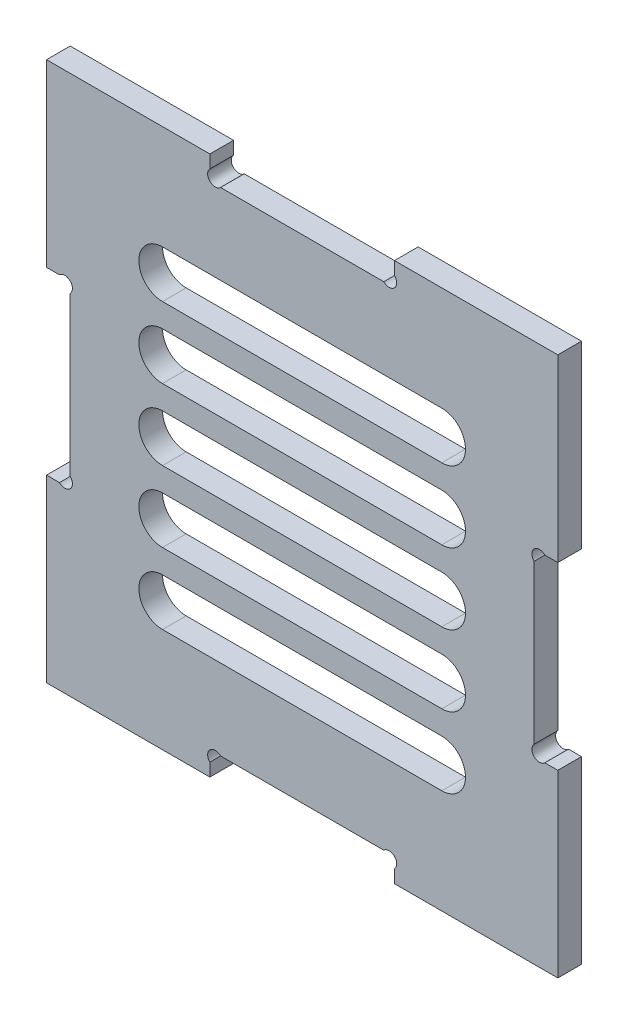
ISO-10303-21;
HEADER;
FILE_DESCRIPTION(('STEP AP214'),'2;1');
FILE_NAME('part.step','',(''),(''),'','','');
FILE_SCHEMA(('AUTOMOTIVE_DESIGN { 1 0 10303 214 1 1 1 1 }'));
ENDSEC;
DATA;
#1=APPLICATION_CONTEXT('core data for automotive mechanical design processes');
#2=APPLICATION_PROTOCOL_DEFINITION('international standard','automotive_design',2000,#1);
#3=PRODUCT_CONTEXT('',#1,'mechanical');
#4=PRODUCT('Part','Part','',(#3));
#5=PRODUCT_RELATED_PRODUCT_CATEGORY('part','',(#4));
#6=PRODUCT_DEFINITION_FORMATION('','',#4);
#7=PRODUCT_DEFINITION_CONTEXT('part definition',#1,'design');
#8=PRODUCT_DEFINITION('design','',#6,#7);
#9=PRODUCT_DEFINITION_SHAPE('','',#8);
#10=(LENGTH_UNIT() NAMED_UNIT(*) SI_UNIT(.MILLI.,.METRE.));
#11=(NAMED_UNIT(*) PLANE_ANGLE_UNIT() SI_UNIT($,.RADIAN.));
#12=(NAMED_UNIT(*) SI_UNIT($,.STERADIAN.) SOLID_ANGLE_UNIT());
#13=UNCERTAINTY_MEASURE_WITH_UNIT(LENGTH_MEASURE(1.E-05),#10,'distance_accuracy_value','');
#14=(GEOMETRIC_REPRESENTATION_CONTEXT(3) GLOBAL_UNCERTAINTY_ASSIGNED_CONTEXT((#13)) GLOBAL_UNIT_ASSIGNED_CONTEXT((#10,
#11,#12)) REPRESENTATION_CONTEXT('',''));
#15=CARTESIAN_POINT('',(0.,0.,0.));
#16=DIRECTION('',(0.,0.,1.));
#17=DIRECTION('',(1.,0.,0.));
#18=AXIS2_PLACEMENT_3D('',#15,#16,#17);
#19=CARTESIAN_POINT('',(40.6151906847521,-71.5767978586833,5.));
#20=DIRECTION('',(0.,0.,1.));
#21=DIRECTION('',(1.,0.,0.));
#22=AXIS2_PLACEMENT_3D('',#19,#20,#21);
#23=PLANE('',#22);
#24=DIRECTION('',(-1.,0.,0.));
#25=VECTOR('',#24,1.);
#26=CARTESIAN_POINT('',(51.7465615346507,-28.4454270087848,5.));
#27=LINE('',#26,#25);
#28=CARTESIAN_POINT('',(51.7465615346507,-28.4454270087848,5.));
#29=VERTEX_POINT('',#28);
#30=CARTESIAN_POINT('',(-7.25343846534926,-28.4454270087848,5.));
#31=VERTEX_POINT('',#30);
#32=EDGE_CURVE('E375',#29,#31,#27,.T.);
#33=ORIENTED_EDGE('',*,*,#32,.F.);
#34=CARTESIAN_POINT('',(51.7465615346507,-33.4454270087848,5.));
#35=DIRECTION('',(0.,0.,1.));
#36=DIRECTION('',(1.,0.,0.));
#37=AXIS2_PLACEMENT_3D('',#34,#35,#36);
#38=CIRCLE('',#37,5.);
#39=CARTESIAN_POINT('',(51.7465615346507,-38.4454270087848,5.));
#40=VERTEX_POINT('',#39);
#41=EDGE_CURVE('E373',#40,#29,#38,.T.);
#42=ORIENTED_EDGE('',*,*,#41,.F.);
#43=DIRECTION('',(1.,0.,0.));
#44=VECTOR('',#43,1.);
#45=CARTESIAN_POINT('',(51.7465615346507,-38.4454270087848,5.));
#46=LINE('',#45,#44);
#47=CARTESIAN_POINT('',(-7.25343846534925,-38.4454270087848,5.));
#48=VERTEX_POINT('',#47);
#49=EDGE_CURVE('E381',#48,#40,#46,.T.);
#50=ORIENTED_EDGE('',*,*,#49,.F.);
#51=CARTESIAN_POINT('',(-7.25343846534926,-33.4454270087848,5.));
#52=DIRECTION('',(0.,0.,1.));
#53=DIRECTION('',(-1.,0.,0.));
#54=AXIS2_PLACEMENT_3D('',#51,#52,#53);
#55=CIRCLE('',#54,5.);
#56=EDGE_CURVE('E378',#31,#48,#55,.T.);
#57=ORIENTED_EDGE('',*,*,#56,.F.);
#58=EDGE_LOOP('',(#33,#42,#50,#57));
#59=FACE_BOUND('',#58,.T.);
#60=DIRECTION('',(-1.,0.,0.));
#61=VECTOR('',#60,1.);
#62=CARTESIAN_POINT('',(51.7465615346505,1.55457299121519,5.));
#63=LINE('',#62,#61);
#64=CARTESIAN_POINT('',(51.7465615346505,1.55457299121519,5.));
#65=VERTEX_POINT('',#64);
#66=CARTESIAN_POINT('',(-7.25343846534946,1.55457299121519,5.));
#67=VERTEX_POINT('',#66);
#68=EDGE_CURVE('E437',#65,#67,#63,.T.);
#69=ORIENTED_EDGE('',*,*,#68,.F.);
#70=CARTESIAN_POINT('',(51.7465615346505,-3.4454270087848,5.));
#71=DIRECTION('',(0.,0.,1.));
#72=DIRECTION('',(1.,0.,0.));
#73=AXIS2_PLACEMENT_3D('',#70,#71,#72);
#74=CIRCLE('',#73,5.);
#75=CARTESIAN_POINT('',(51.7465615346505,-8.4454270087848,5.));
#76=VERTEX_POINT('',#75);
#77=EDGE_CURVE('E435',#76,#65,#74,.T.);
#78=ORIENTED_EDGE('',*,*,#77,.F.);
#79=DIRECTION('',(1.,0.,0.));
#80=VECTOR('',#79,1.);
#81=CARTESIAN_POINT('',(51.7465615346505,-8.4454270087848,5.));
#82=LINE('',#81,#80);
#83=CARTESIAN_POINT('',(-7.25343846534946,-8.4454270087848,5.));
#84=VERTEX_POINT('',#83);
#85=EDGE_CURVE('E443',#84,#76,#82,.T.);
#86=ORIENTED_EDGE('',*,*,#85,.F.);
#87=CARTESIAN_POINT('',(-7.25343846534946,-3.4454270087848,5.));
#88=DIRECTION('',(0.,0.,1.));
#89=DIRECTION('',(-1.,0.,0.));
#90=AXIS2_PLACEMENT_3D('',#87,#88,#89);
#91=CIRCLE('',#90,5.);
#92=EDGE_CURVE('E440',#67,#84,#91,.T.);
#93=ORIENTED_EDGE('',*,*,#92,.F.);
#94=EDGE_LOOP('',(#69,#78,#86,#93));
#95=FACE_BOUND('',#94,.T.);
#96=CARTESIAN_POINT('',(40.6151906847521,-71.5767978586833,5.));
#97=DIRECTION('',(0.,0.,-1.));
#98=DIRECTION('',(1.,0.,0.));
#99=AXIS2_PLACEMENT_3D('',#96,#97,#98);
#100=CIRCLE('',#99,1.59999999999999);
#101=CARTESIAN_POINT('',(39.4838198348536,-70.4454270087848,5.));
#102=VERTEX_POINT('',#101);
#103=CARTESIAN_POINT('',(41.7465615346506,-72.7081687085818,5.));
#104=VERTEX_POINT('',#103);
#105=EDGE_CURVE('E497',#102,#104,#100,.T.);
#106=ORIENTED_EDGE('',*,*,#105,.T.);
#107=DIRECTION('',(0.,-1.,0.));
#108=VECTOR('',#107,1.);
#109=CARTESIAN_POINT('',(41.7465615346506,-75.4454270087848,5.));
#110=LINE('',#109,#108);
#111=CARTESIAN_POINT('',(41.7465615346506,-75.4454270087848,5.));
#112=VERTEX_POINT('',#111);
#113=EDGE_CURVE('E500',#104,#112,#110,.T.);
#114=ORIENTED_EDGE('',*,*,#113,.T.);
#115=DIRECTION('',(1.,0.,0.));
#116=VECTOR('',#115,1.);
#117=CARTESIAN_POINT('',(76.2465615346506,-75.4454270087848,5.));
#118=LINE('',#117,#116);
#119=CARTESIAN_POINT('',(76.2465615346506,-75.4454270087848,5.));
#120=VERTEX_POINT('',#119);
#121=EDGE_CURVE('E503',#112,#120,#118,.T.);
#122=ORIENTED_EDGE('',*,*,#121,.T.);
#123=DIRECTION('',(0.,1.,0.));
#124=VECTOR('',#123,1.);
#125=CARTESIAN_POINT('',(76.2465615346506,-37.4454270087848,5.));
#126=LINE('',#125,#124);
#127=CARTESIAN_POINT('',(76.2465615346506,-37.4454270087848,5.));
#128=VERTEX_POINT('',#127);
#129=EDGE_CURVE('E505',#120,#128,#126,.T.);
#130=ORIENTED_EDGE('',*,*,#129,.T.);
#131=DIRECTION('',(-1.,0.,0.));
#132=VECTOR('',#131,1.);
#133=CARTESIAN_POINT('',(73.5093032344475,-37.4454270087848,5.));
#134=LINE('',#133,#132);
#135=CARTESIAN_POINT('',(73.5093032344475,-37.4454270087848,5.));
#136=VERTEX_POINT('',#135);
#137=EDGE_CURVE('E507',#128,#136,#134,.T.);
#138=ORIENTED_EDGE('',*,*,#137,.T.);
#139=CARTESIAN_POINT('',(72.377932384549,-36.3140561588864,5.));
#140=DIRECTION('',(0.,0.,-1.));
#141=DIRECTION('',(1.,0.,0.));
#142=AXIS2_PLACEMENT_3D('',#139,#140,#141);
#143=CIRCLE('',#142,1.59999999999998);
#144=CARTESIAN_POINT('',(71.2465615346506,-35.1826853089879,5.));
#145=VERTEX_POINT('',#144);
#146=EDGE_CURVE('E509',#136,#145,#143,.T.);
#147=ORIENTED_EDGE('',*,*,#146,.T.);
#148=DIRECTION('',(0.,1.,0.));
#149=VECTOR('',#148,1.);
#150=CARTESIAN_POINT('',(71.2465615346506,-35.1826853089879,5.));
#151=LINE('',#150,#149);
#152=CARTESIAN_POINT('',(71.2465615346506,-1.70816870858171,5.));
#153=VERTEX_POINT('',#152);
#154=EDGE_CURVE('E511',#145,#153,#151,.T.);
#155=ORIENTED_EDGE('',*,*,#154,.T.);
#156=CARTESIAN_POINT('',(72.377932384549,-0.57679785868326,5.));
#157=DIRECTION('',(0.,0.,-1.));
#158=DIRECTION('',(-1.,0.,0.));
#159=AXIS2_PLACEMENT_3D('',#156,#157,#158);
#160=CIRCLE('',#159,1.59999999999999);
#161=CARTESIAN_POINT('',(73.5093032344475,0.554572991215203,5.));
#162=VERTEX_POINT('',#161);
#163=EDGE_CURVE('E513',#153,#162,#160,.T.);
#164=ORIENTED_EDGE('',*,*,#163,.T.);
#165=DIRECTION('',(1.,0.,0.));
#166=VECTOR('',#165,1.);
#167=CARTESIAN_POINT('',(73.5093032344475,0.554572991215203,5.));
#168=LINE('',#167,#166);
#169=CARTESIAN_POINT('',(76.2465615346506,0.554572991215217,5.));
#170=VERTEX_POINT('',#169);
#171=EDGE_CURVE('E515',#162,#170,#168,.T.);
#172=ORIENTED_EDGE('',*,*,#171,.T.);
#173=DIRECTION('',(0.,1.,0.));
#174=VECTOR('',#173,1.);
#175=CARTESIAN_POINT('',(76.2465615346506,0.554572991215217,5.));
#176=LINE('',#175,#174);
#177=CARTESIAN_POINT('',(76.2465615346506,38.5545729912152,5.));
#178=VERTEX_POINT('',#177);
#179=EDGE_CURVE('E517',#170,#178,#176,.T.);
#180=ORIENTED_EDGE('',*,*,#179,.T.);
#181=DIRECTION('',(-1.,0.,0.));
#182=VECTOR('',#181,1.);
#183=CARTESIAN_POINT('',(76.2465615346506,38.5545729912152,5.));
#184=LINE('',#183,#182);
#185=CARTESIAN_POINT('',(41.7465615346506,38.5545729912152,5.));
#186=VERTEX_POINT('',#185);
#187=EDGE_CURVE('E519',#178,#186,#184,.T.);
#188=ORIENTED_EDGE('',*,*,#187,.T.);
#189=DIRECTION('',(0.,-1.,0.));
#190=VECTOR('',#189,1.);
#191=CARTESIAN_POINT('',(41.7465615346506,38.5545729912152,5.));
#192=LINE('',#191,#190);
#193=CARTESIAN_POINT('',(41.7465615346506,35.8173146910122,5.));
#194=VERTEX_POINT('',#193);
#195=EDGE_CURVE('E521',#186,#194,#192,.T.);
#196=ORIENTED_EDGE('',*,*,#195,.T.);
#197=CARTESIAN_POINT('',(40.6151906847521,34.6859438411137,5.));
#198=DIRECTION('',(0.,0.,-1.));
#199=DIRECTION('',(-1.,0.,0.));
#200=AXIS2_PLACEMENT_3D('',#197,#198,#199);
#201=CIRCLE('',#200,1.6);
#202=CARTESIAN_POINT('',(39.4838198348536,33.5545729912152,5.));
#203=VERTEX_POINT('',#202);
#204=EDGE_CURVE('E523',#194,#203,#201,.T.);
#205=ORIENTED_EDGE('',*,*,#204,.T.);
#206=DIRECTION('',(-1.,0.,0.));
#207=VECTOR('',#206,1.);
#208=CARTESIAN_POINT('',(39.4838198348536,33.5545729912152,5.));
#209=LINE('',#208,#207);
#210=CARTESIAN_POINT('',(5.00930323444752,33.5545729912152,5.));
#211=VERTEX_POINT('',#210);
#212=EDGE_CURVE('E525',#203,#211,#209,.T.);
#213=ORIENTED_EDGE('',*,*,#212,.T.);
#214=CARTESIAN_POINT('',(3.87793238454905,34.6859438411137,5.));
#215=DIRECTION('',(0.,0.,-1.));
#216=DIRECTION('',(1.,0.,0.));
#217=AXIS2_PLACEMENT_3D('',#214,#215,#216);
#218=CIRCLE('',#217,1.6);
#219=CARTESIAN_POINT('',(2.74656153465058,35.8173146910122,5.));
#220=VERTEX_POINT('',#219);
#221=EDGE_CURVE('E527',#211,#220,#218,.T.);
#222=ORIENTED_EDGE('',*,*,#221,.T.);
#223=DIRECTION('',(0.,1.,0.));
#224=VECTOR('',#223,1.);
#225=CARTESIAN_POINT('',(2.74656153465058,38.5545729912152,5.));
#226=LINE('',#225,#224);
#227=CARTESIAN_POINT('',(2.74656153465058,38.5545729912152,5.));
#228=VERTEX_POINT('',#227);
#229=EDGE_CURVE('E529',#220,#228,#226,.T.);
#230=ORIENTED_EDGE('',*,*,#229,.T.);
#231=DIRECTION('',(-1.,0.,0.));
#232=VECTOR('',#231,1.);
#233=CARTESIAN_POINT('',(-31.7534384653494,38.5545729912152,5.));
#234=LINE('',#233,#232);
#235=CARTESIAN_POINT('',(-31.7534384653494,38.5545729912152,5.));
#236=VERTEX_POINT('',#235);
#237=EDGE_CURVE('E531',#228,#236,#234,.T.);
#238=ORIENTED_EDGE('',*,*,#237,.T.);
#239=DIRECTION('',(0.,-1.,0.));
#240=VECTOR('',#239,1.);
#241=CARTESIAN_POINT('',(-31.7534384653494,0.554572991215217,5.));
#242=LINE('',#241,#240);
#243=CARTESIAN_POINT('',(-31.7534384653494,0.554572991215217,5.));
#244=VERTEX_POINT('',#243);
#245=EDGE_CURVE('E533',#236,#244,#242,.T.);
#246=ORIENTED_EDGE('',*,*,#245,.T.);
#247=DIRECTION('',(1.,0.,0.));
#248=VECTOR('',#247,1.);
#249=CARTESIAN_POINT('',(-29.0161801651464,0.554572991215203,5.));
#250=LINE('',#249,#248);
#251=CARTESIAN_POINT('',(-29.0161801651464,0.554572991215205,5.));
#252=VERTEX_POINT('',#251);
#253=EDGE_CURVE('E535',#244,#252,#250,.T.);
#254=ORIENTED_EDGE('',*,*,#253,.T.);
#255=CARTESIAN_POINT('',(-27.8848093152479,-0.57679785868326,5.));
#256=DIRECTION('',(0.,0.,-1.));
#257=DIRECTION('',(1.,0.,0.));
#258=AXIS2_PLACEMENT_3D('',#255,#256,#257);
#259=CIRCLE('',#258,1.59999999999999);
#260=CARTESIAN_POINT('',(-26.7534384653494,-1.70816870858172,5.));
#261=VERTEX_POINT('',#260);
#262=EDGE_CURVE('E537',#252,#261,#259,.T.);
#263=ORIENTED_EDGE('',*,*,#262,.T.);
#264=DIRECTION('',(0.,-1.,0.));
#265=VECTOR('',#264,1.);
#266=CARTESIAN_POINT('',(-26.7534384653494,-1.70816870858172,5.));
#267=LINE('',#266,#265);
#268=CARTESIAN_POINT('',(-26.7534384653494,-35.1826853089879,5.));
#269=VERTEX_POINT('',#268);
#270=EDGE_CURVE('E539',#261,#269,#267,.T.);
#271=ORIENTED_EDGE('',*,*,#270,.T.);
#272=CARTESIAN_POINT('',(-27.8848093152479,-36.3140561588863,5.));
#273=DIRECTION('',(0.,0.,-1.));
#274=DIRECTION('',(-1.,0.,0.));
#275=AXIS2_PLACEMENT_3D('',#272,#273,#274);
#276=CIRCLE('',#275,1.59999999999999);
#277=CARTESIAN_POINT('',(-29.0161801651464,-37.4454270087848,5.));
#278=VERTEX_POINT('',#277);
#279=EDGE_CURVE('E541',#269,#278,#276,.T.);
#280=ORIENTED_EDGE('',*,*,#279,.T.);
#281=DIRECTION('',(-1.,0.,0.));
#282=VECTOR('',#281,1.);
#283=CARTESIAN_POINT('',(-29.0161801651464,-37.4454270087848,5.));
#284=LINE('',#283,#282);
#285=CARTESIAN_POINT('',(-31.7534384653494,-37.4454270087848,5.));
#286=VERTEX_POINT('',#285);
#287=EDGE_CURVE('E543',#278,#286,#284,.T.);
#288=ORIENTED_EDGE('',*,*,#287,.T.);
#289=DIRECTION('',(0.,-1.,0.));
#290=VECTOR('',#289,1.);
#291=CARTESIAN_POINT('',(-31.7534384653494,-37.4454270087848,5.));
#292=LINE('',#291,#290);
#293=CARTESIAN_POINT('',(-31.7534384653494,-75.4454270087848,5.));
#294=VERTEX_POINT('',#293);
#295=EDGE_CURVE('E545',#286,#294,#292,.T.);
#296=ORIENTED_EDGE('',*,*,#295,.T.);
#297=DIRECTION('',(1.,0.,0.));
#298=VECTOR('',#297,1.);
#299=CARTESIAN_POINT('',(-31.7534384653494,-75.4454270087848,5.));
#300=LINE('',#299,#298);
#301=CARTESIAN_POINT('',(2.74656153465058,-75.4454270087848,5.));
#302=VERTEX_POINT('',#301);
#303=EDGE_CURVE('E547',#294,#302,#300,.T.);
#304=ORIENTED_EDGE('',*,*,#303,.T.);
#305=DIRECTION('',(0.,1.,0.));
#306=VECTOR('',#305,1.);
#307=CARTESIAN_POINT('',(2.74656153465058,-75.4454270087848,5.));
#308=LINE('',#307,#306);
#309=CARTESIAN_POINT('',(2.74656153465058,-72.7081687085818,5.));
#310=VERTEX_POINT('',#309);
#311=EDGE_CURVE('E549',#302,#310,#308,.T.);
#312=ORIENTED_EDGE('',*,*,#311,.T.);
#313=CARTESIAN_POINT('',(3.87793238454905,-71.5767978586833,5.));
#314=DIRECTION('',(0.,0.,-1.));
#315=DIRECTION('',(-1.,0.,0.));
#316=AXIS2_PLACEMENT_3D('',#313,#314,#315);
#317=CIRCLE('',#316,1.6);
#318=CARTESIAN_POINT('',(5.00930323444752,-70.4454270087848,5.));
#319=VERTEX_POINT('',#318);
#320=EDGE_CURVE('E551',#310,#319,#317,.T.);
#321=ORIENTED_EDGE('',*,*,#320,.T.);
#322=DIRECTION('',(1.,0.,0.));
#323=VECTOR('',#322,1.);
#324=CARTESIAN_POINT('',(39.4838198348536,-70.4454270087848,5.));
#325=LINE('',#324,#323);
#326=EDGE_CURVE('E553',#319,#102,#325,.T.);
#327=ORIENTED_EDGE('',*,*,#326,.T.);
#328=EDGE_LOOP('',(#106,#114,#122,#130,#138,#147,#155,#164,#172,#180,#188,#196,#205,#213,#222,
#230,#238,#246,#254,#263,#271,#280,#288,#296,#304,#312,#321,#327));
#329=FACE_BOUND('',#328,.T.);
#330=DIRECTION('',(-1.,0.,0.));
#331=VECTOR('',#330,1.);
#332=CARTESIAN_POINT('',(51.7465615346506,-13.4454270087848,5.));
#333=LINE('',#332,#331);
#334=CARTESIAN_POINT('',(51.7465615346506,-13.4454270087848,5.));
#335=VERTEX_POINT('',#334);
#336=CARTESIAN_POINT('',(-7.25343846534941,-13.4454270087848,5.));
#337=VERTEX_POINT('',#336);
#338=EDGE_CURVE('E468',#335,#337,#333,.T.);
#339=ORIENTED_EDGE('',*,*,#338,.F.);
#340=CARTESIAN_POINT('',(51.7465615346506,-18.4454270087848,5.));
#341=DIRECTION('',(0.,0.,1.));
#342=DIRECTION('',(1.,0.,0.));
#343=AXIS2_PLACEMENT_3D('',#340,#341,#342);
#344=CIRCLE('',#343,5.);
#345=CARTESIAN_POINT('',(51.7465615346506,-23.4454270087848,5.));
#346=VERTEX_POINT('',#345);
#347=EDGE_CURVE('E466',#346,#335,#344,.T.);
#348=ORIENTED_EDGE('',*,*,#347,.F.);
#349=DIRECTION('',(1.,0.,0.));
#350=VECTOR('',#349,1.);
#351=CARTESIAN_POINT('',(51.7465615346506,-23.4454270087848,5.));
#352=LINE('',#351,#350);
#353=CARTESIAN_POINT('',(-7.25343846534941,-23.4454270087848,5.));
#354=VERTEX_POINT('',#353);
#355=EDGE_CURVE('E474',#354,#346,#352,.T.);
#356=ORIENTED_EDGE('',*,*,#355,.F.);
#357=CARTESIAN_POINT('',(-7.25343846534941,-18.4454270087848,5.));
#358=DIRECTION('',(0.,0.,1.));
#359=DIRECTION('',(-1.,0.,0.));
#360=AXIS2_PLACEMENT_3D('',#357,#358,#359);
#361=CIRCLE('',#360,5.);
#362=EDGE_CURVE('E471',#337,#354,#361,.T.);
#363=ORIENTED_EDGE('',*,*,#362,.F.);
#364=EDGE_LOOP('',(#339,#348,#356,#363));
#365=FACE_BOUND('',#364,.T.);
#366=DIRECTION('',(-1.,0.,0.));
#367=VECTOR('',#366,1.);
#368=CARTESIAN_POINT('',(51.7465615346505,16.5545729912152,5.));
#369=LINE('',#368,#367);
#370=CARTESIAN_POINT('',(51.7465615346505,16.5545729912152,5.));
#371=VERTEX_POINT('',#370);
#372=CARTESIAN_POINT('',(-7.25343846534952,16.5545729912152,5.));
#373=VERTEX_POINT('',#372);
#374=EDGE_CURVE('E406',#371,#373,#369,.T.);
#375=ORIENTED_EDGE('',*,*,#374,.F.);
#376=CARTESIAN_POINT('',(51.7465615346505,11.5545729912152,5.));
#377=DIRECTION('',(0.,0.,1.));
#378=DIRECTION('',(1.,0.,0.));
#379=AXIS2_PLACEMENT_3D('',#376,#377,#378);
#380=CIRCLE('',#379,5.);
#381=CARTESIAN_POINT('',(51.7465615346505,6.5545729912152,5.));
#382=VERTEX_POINT('',#381);
#383=EDGE_CURVE('E404',#382,#371,#380,.T.);
#384=ORIENTED_EDGE('',*,*,#383,.F.);
#385=DIRECTION('',(1.,0.,0.));
#386=VECTOR('',#385,1.);
#387=CARTESIAN_POINT('',(51.7465615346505,6.5545729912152,5.));
#388=LINE('',#387,#386);
#389=CARTESIAN_POINT('',(-7.25343846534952,6.5545729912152,5.));
#390=VERTEX_POINT('',#389);
#391=EDGE_CURVE('E412',#390,#382,#388,.T.);
#392=ORIENTED_EDGE('',*,*,#391,.F.);
#393=CARTESIAN_POINT('',(-7.25343846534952,11.5545729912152,5.));
#394=DIRECTION('',(0.,0.,1.));
#395=DIRECTION('',(-1.,0.,0.));
#396=AXIS2_PLACEMENT_3D('',#393,#394,#395);
#397=CIRCLE('',#396,5.);
#398=EDGE_CURVE('E409',#373,#390,#397,.T.);
#399=ORIENTED_EDGE('',*,*,#398,.F.);
#400=EDGE_LOOP('',(#375,#384,#392,#399));
#401=FACE_BOUND('',#400,.T.);
#402=DIRECTION('',(-1.,0.,0.));
#403=VECTOR('',#402,1.);
#404=CARTESIAN_POINT('',(51.7465615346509,-43.4454270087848,5.));
#405=LINE('',#404,#403);
#406=CARTESIAN_POINT('',(51.7465615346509,-43.4454270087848,5.));
#407=VERTEX_POINT('',#406);
#408=CARTESIAN_POINT('',(-7.2534384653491,-43.4454270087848,5.));
#409=VERTEX_POINT('',#408);
#410=EDGE_CURVE('E345',#407,#409,#405,.T.);
#411=ORIENTED_EDGE('',*,*,#410,.F.);
#412=CARTESIAN_POINT('',(51.7465615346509,-48.4454270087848,5.));
#413=DIRECTION('',(0.,0.,1.));
#414=DIRECTION('',(1.,0.,0.));
#415=AXIS2_PLACEMENT_3D('',#412,#413,#414);
#416=CIRCLE('',#415,5.);
#417=CARTESIAN_POINT('',(51.7465615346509,-53.4454270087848,5.));
#418=VERTEX_POINT('',#417);
#419=EDGE_CURVE('E337',#418,#407,#416,.T.);
#420=ORIENTED_EDGE('',*,*,#419,.F.);
#421=DIRECTION('',(1.,0.,0.));
#422=VECTOR('',#421,1.);
#423=CARTESIAN_POINT('',(51.7465615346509,-53.4454270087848,5.));
#424=LINE('',#423,#422);
#425=CARTESIAN_POINT('',(-7.25343846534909,-53.4454270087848,5.));
#426=VERTEX_POINT('',#425);
#427=EDGE_CURVE('E359',#426,#418,#424,.T.);
#428=ORIENTED_EDGE('',*,*,#427,.F.);
#429=CARTESIAN_POINT('',(-7.2534384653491,-48.4454270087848,5.));
#430=DIRECTION('',(0.,0.,1.));
#431=DIRECTION('',(-1.,0.,0.));
#432=AXIS2_PLACEMENT_3D('',#429,#430,#431);
#433=CIRCLE('',#432,5.);
#434=EDGE_CURVE('E357',#409,#426,#433,.T.);
#435=ORIENTED_EDGE('',*,*,#434,.F.);
#436=EDGE_LOOP('',(#411,#420,#428,#435));
#437=FACE_BOUND('',#436,.T.);
#438=ADVANCED_FACE('F32',(#59,#95,#329,#365,#401,#437),#23,.T.);
#439=CARTESIAN_POINT('',(40.6151906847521,-71.5767978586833,0.));
#440=DIRECTION('',(0.,0.,1.));
#441=DIRECTION('',(1.,0.,0.));
#442=AXIS2_PLACEMENT_3D('',#439,#440,#441);
#443=PLANE('',#442);
#444=CARTESIAN_POINT('',(51.7465615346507,-33.4454270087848,0.));
#445=DIRECTION('',(0.,0.,1.));
#446=DIRECTION('',(1.,0.,0.));
#447=AXIS2_PLACEMENT_3D('',#444,#445,#446);
#448=CIRCLE('',#447,5.);
#449=CARTESIAN_POINT('',(51.7465615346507,-38.4454270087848,0.));
#450=VERTEX_POINT('',#449);
#451=CARTESIAN_POINT('',(51.7465615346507,-28.4454270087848,0.));
#452=VERTEX_POINT('',#451);
#453=EDGE_CURVE('E353',#450,#452,#448,.T.);
#454=ORIENTED_EDGE('',*,*,#453,.T.);
#455=DIRECTION('',(-1.,0.,0.));
#456=VECTOR('',#455,1.);
#457=CARTESIAN_POINT('',(51.7465615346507,-28.4454270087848,0.));
#458=LINE('',#457,#456);
#459=CARTESIAN_POINT('',(-7.25343846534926,-28.4454270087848,0.));
#460=VERTEX_POINT('',#459);
#461=EDGE_CURVE('E386',#452,#460,#458,.T.);
#462=ORIENTED_EDGE('',*,*,#461,.T.);
#463=CARTESIAN_POINT('',(-7.25343846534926,-33.4454270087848,0.));
#464=DIRECTION('',(0.,0.,1.));
#465=DIRECTION('',(-1.,0.,0.));
#466=AXIS2_PLACEMENT_3D('',#463,#464,#465);
#467=CIRCLE('',#466,5.);
#468=CARTESIAN_POINT('',(-7.25343846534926,-38.4454270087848,0.));
#469=VERTEX_POINT('',#468);
#470=EDGE_CURVE('E389',#460,#469,#467,.T.);
#471=ORIENTED_EDGE('',*,*,#470,.T.);
#472=DIRECTION('',(1.,0.,0.));
#473=VECTOR('',#472,1.);
#474=CARTESIAN_POINT('',(51.7465615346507,-38.4454270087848,0.));
#475=LINE('',#474,#473);
#476=EDGE_CURVE('E376',#469,#450,#475,.T.);
#477=ORIENTED_EDGE('',*,*,#476,.T.);
#478=EDGE_LOOP('',(#454,#462,#471,#477));
#479=FACE_BOUND('',#478,.T.);
#480=CARTESIAN_POINT('',(51.7465615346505,-3.4454270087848,0.));
#481=DIRECTION('',(0.,0.,1.));
#482=DIRECTION('',(1.,0.,0.));
#483=AXIS2_PLACEMENT_3D('',#480,#481,#482);
#484=CIRCLE('',#483,5.);
#485=CARTESIAN_POINT('',(51.7465615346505,-8.4454270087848,0.));
#486=VERTEX_POINT('',#485);
#487=CARTESIAN_POINT('',(51.7465615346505,1.55457299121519,0.));
#488=VERTEX_POINT('',#487);
#489=EDGE_CURVE('E434',#486,#488,#484,.T.);
#490=ORIENTED_EDGE('',*,*,#489,.T.);
#491=DIRECTION('',(-1.,0.,0.));
#492=VECTOR('',#491,1.);
#493=CARTESIAN_POINT('',(51.7465615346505,1.55457299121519,0.));
#494=LINE('',#493,#492);
#495=CARTESIAN_POINT('',(-7.25343846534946,1.55457299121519,0.));
#496=VERTEX_POINT('',#495);
#497=EDGE_CURVE('E448',#488,#496,#494,.T.);
#498=ORIENTED_EDGE('',*,*,#497,.T.);
#499=CARTESIAN_POINT('',(-7.25343846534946,-3.4454270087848,0.));
#500=DIRECTION('',(0.,0.,1.));
#501=DIRECTION('',(-1.,0.,0.));
#502=AXIS2_PLACEMENT_3D('',#499,#500,#501);
#503=CIRCLE('',#502,5.);
#504=CARTESIAN_POINT('',(-7.25343846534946,-8.4454270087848,0.));
#505=VERTEX_POINT('',#504);
#506=EDGE_CURVE('E451',#496,#505,#503,.T.);
#507=ORIENTED_EDGE('',*,*,#506,.T.);
#508=DIRECTION('',(1.,0.,0.));
#509=VECTOR('',#508,1.);
#510=CARTESIAN_POINT('',(51.7465615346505,-8.4454270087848,0.));
#511=LINE('',#510,#509);
#512=EDGE_CURVE('E438',#505,#486,#511,.T.);
#513=ORIENTED_EDGE('',*,*,#512,.T.);
#514=EDGE_LOOP('',(#490,#498,#507,#513));
#515=FACE_BOUND('',#514,.T.);
#516=CARTESIAN_POINT('',(40.6151906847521,-71.5767978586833,0.));
#517=DIRECTION('',(0.,0.,-1.));
#518=DIRECTION('',(1.,0.,0.));
#519=AXIS2_PLACEMENT_3D('',#516,#517,#518);
#520=CIRCLE('',#519,1.59999999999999);
#521=CARTESIAN_POINT('',(39.4838198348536,-70.4454270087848,0.));
#522=VERTEX_POINT('',#521);
#523=CARTESIAN_POINT('',(41.7465615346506,-72.7081687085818,0.));
#524=VERTEX_POINT('',#523);
#525=EDGE_CURVE('E496',#522,#524,#520,.T.);
#526=ORIENTED_EDGE('',*,*,#525,.F.);
#527=DIRECTION('',(1.,0.,0.));
#528=VECTOR('',#527,1.);
#529=CARTESIAN_POINT('',(39.4838198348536,-70.4454270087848,0.));
#530=LINE('',#529,#528);
#531=CARTESIAN_POINT('',(5.00930323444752,-70.4454270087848,0.));
#532=VERTEX_POINT('',#531);
#533=EDGE_CURVE('E501',#532,#522,#530,.T.);
#534=ORIENTED_EDGE('',*,*,#533,.F.);
#535=CARTESIAN_POINT('',(3.87793238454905,-71.5767978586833,0.));
#536=DIRECTION('',(0.,0.,-1.));
#537=DIRECTION('',(-1.,0.,0.));
#538=AXIS2_PLACEMENT_3D('',#535,#536,#537);
#539=CIRCLE('',#538,1.6);
#540=CARTESIAN_POINT('',(2.74656153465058,-72.7081687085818,0.));
#541=VERTEX_POINT('',#540);
#542=EDGE_CURVE('E608',#541,#532,#539,.T.);
#543=ORIENTED_EDGE('',*,*,#542,.F.);
#544=DIRECTION('',(0.,1.,0.));
#545=VECTOR('',#544,1.);
#546=CARTESIAN_POINT('',(2.74656153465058,-75.4454270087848,0.));
#547=LINE('',#546,#545);
#548=CARTESIAN_POINT('',(2.74656153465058,-75.4454270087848,0.));
#549=VERTEX_POINT('',#548);
#550=EDGE_CURVE('E606',#549,#541,#547,.T.);
#551=ORIENTED_EDGE('',*,*,#550,.F.);
#552=DIRECTION('',(1.,0.,0.));
#553=VECTOR('',#552,1.);
#554=CARTESIAN_POINT('',(-31.7534384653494,-75.4454270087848,0.));
#555=LINE('',#554,#553);
#556=CARTESIAN_POINT('',(-31.7534384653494,-75.4454270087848,0.));
#557=VERTEX_POINT('',#556);
#558=EDGE_CURVE('E604',#557,#549,#555,.T.);
#559=ORIENTED_EDGE('',*,*,#558,.F.);
#560=DIRECTION('',(0.,-1.,0.));
#561=VECTOR('',#560,1.);
#562=CARTESIAN_POINT('',(-31.7534384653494,-37.4454270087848,0.));
#563=LINE('',#562,#561);
#564=CARTESIAN_POINT('',(-31.7534384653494,-37.4454270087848,0.));
#565=VERTEX_POINT('',#564);
#566=EDGE_CURVE('E602',#565,#557,#563,.T.);
#567=ORIENTED_EDGE('',*,*,#566,.F.);
#568=DIRECTION('',(-1.,0.,0.));
#569=VECTOR('',#568,1.);
#570=CARTESIAN_POINT('',(-29.0161801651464,-37.4454270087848,0.));
#571=LINE('',#570,#569);
#572=CARTESIAN_POINT('',(-29.0161801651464,-37.4454270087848,0.));
#573=VERTEX_POINT('',#572);
#574=EDGE_CURVE('E600',#573,#565,#571,.T.);
#575=ORIENTED_EDGE('',*,*,#574,.F.);
#576=CARTESIAN_POINT('',(-27.8848093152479,-36.3140561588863,0.));
#577=DIRECTION('',(0.,0.,-1.));
#578=DIRECTION('',(-1.,0.,0.));
#579=AXIS2_PLACEMENT_3D('',#576,#577,#578);
#580=CIRCLE('',#579,1.59999999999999);
#581=CARTESIAN_POINT('',(-26.7534384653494,-35.1826853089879,0.));
#582=VERTEX_POINT('',#581);
#583=EDGE_CURVE('E598',#582,#573,#580,.T.);
#584=ORIENTED_EDGE('',*,*,#583,.F.);
#585=DIRECTION('',(0.,-1.,0.));
#586=VECTOR('',#585,1.);
#587=CARTESIAN_POINT('',(-26.7534384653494,-1.70816870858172,0.));
#588=LINE('',#587,#586);
#589=CARTESIAN_POINT('',(-26.7534384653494,-1.70816870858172,0.));
#590=VERTEX_POINT('',#589);
#591=EDGE_CURVE('E596',#590,#582,#588,.T.);
#592=ORIENTED_EDGE('',*,*,#591,.F.);
#593=CARTESIAN_POINT('',(-27.8848093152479,-0.57679785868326,0.));
#594=DIRECTION('',(0.,0.,-1.));
#595=DIRECTION('',(1.,0.,0.));
#596=AXIS2_PLACEMENT_3D('',#593,#594,#595);
#597=CIRCLE('',#596,1.59999999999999);
#598=CARTESIAN_POINT('',(-29.0161801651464,0.554572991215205,0.));
#599=VERTEX_POINT('',#598);
#600=EDGE_CURVE('E594',#599,#590,#597,.T.);
#601=ORIENTED_EDGE('',*,*,#600,.F.);
#602=DIRECTION('',(1.,0.,0.));
#603=VECTOR('',#602,1.);
#604=CARTESIAN_POINT('',(-29.0161801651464,0.554572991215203,0.));
#605=LINE('',#604,#603);
#606=CARTESIAN_POINT('',(-31.7534384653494,0.554572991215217,0.));
#607=VERTEX_POINT('',#606);
#608=EDGE_CURVE('E592',#607,#599,#605,.T.);
#609=ORIENTED_EDGE('',*,*,#608,.F.);
#610=DIRECTION('',(0.,-1.,0.));
#611=VECTOR('',#610,1.);
#612=CARTESIAN_POINT('',(-31.7534384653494,0.554572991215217,0.));
#613=LINE('',#612,#611);
#614=CARTESIAN_POINT('',(-31.7534384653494,38.5545729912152,0.));
#615=VERTEX_POINT('',#614);
#616=EDGE_CURVE('E590',#615,#607,#613,.T.);
#617=ORIENTED_EDGE('',*,*,#616,.F.);
#618=DIRECTION('',(-1.,0.,0.));
#619=VECTOR('',#618,1.);
#620=CARTESIAN_POINT('',(-31.7534384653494,38.5545729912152,0.));
#621=LINE('',#620,#619);
#622=CARTESIAN_POINT('',(2.74656153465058,38.5545729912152,0.));
#623=VERTEX_POINT('',#622);
#624=EDGE_CURVE('E588',#623,#615,#621,.T.);
#625=ORIENTED_EDGE('',*,*,#624,.F.);
#626=DIRECTION('',(0.,1.,0.));
#627=VECTOR('',#626,1.);
#628=CARTESIAN_POINT('',(2.74656153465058,38.5545729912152,0.));
#629=LINE('',#628,#627);
#630=CARTESIAN_POINT('',(2.74656153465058,35.8173146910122,0.));
#631=VERTEX_POINT('',#630);
#632=EDGE_CURVE('E586',#631,#623,#629,.T.);
#633=ORIENTED_EDGE('',*,*,#632,.F.);
#634=CARTESIAN_POINT('',(3.87793238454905,34.6859438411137,0.));
#635=DIRECTION('',(0.,0.,-1.));
#636=DIRECTION('',(1.,0.,0.));
#637=AXIS2_PLACEMENT_3D('',#634,#635,#636);
#638=CIRCLE('',#637,1.6);
#639=CARTESIAN_POINT('',(5.00930323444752,33.5545729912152,0.));
#640=VERTEX_POINT('',#639);
#641=EDGE_CURVE('E584',#640,#631,#638,.T.);
#642=ORIENTED_EDGE('',*,*,#641,.F.);
#643=DIRECTION('',(-1.,0.,0.));
#644=VECTOR('',#643,1.);
#645=CARTESIAN_POINT('',(39.4838198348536,33.5545729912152,0.));
#646=LINE('',#645,#644);
#647=CARTESIAN_POINT('',(39.4838198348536,33.5545729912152,0.));
#648=VERTEX_POINT('',#647);
#649=EDGE_CURVE('E582',#648,#640,#646,.T.);
#650=ORIENTED_EDGE('',*,*,#649,.F.);
#651=CARTESIAN_POINT('',(40.6151906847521,34.6859438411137,0.));
#652=DIRECTION('',(0.,0.,-1.));
#653=DIRECTION('',(-1.,0.,0.));
#654=AXIS2_PLACEMENT_3D('',#651,#652,#653);
#655=CIRCLE('',#654,1.6);
#656=CARTESIAN_POINT('',(41.7465615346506,35.8173146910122,0.));
#657=VERTEX_POINT('',#656);
#658=EDGE_CURVE('E580',#657,#648,#655,.T.);
#659=ORIENTED_EDGE('',*,*,#658,.F.);
#660=DIRECTION('',(0.,-1.,0.));
#661=VECTOR('',#660,1.);
#662=CARTESIAN_POINT('',(41.7465615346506,38.5545729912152,0.));
#663=LINE('',#662,#661);
#664=CARTESIAN_POINT('',(41.7465615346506,38.5545729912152,0.));
#665=VERTEX_POINT('',#664);
#666=EDGE_CURVE('E578',#665,#657,#663,.T.);
#667=ORIENTED_EDGE('',*,*,#666,.F.);
#668=DIRECTION('',(-1.,0.,0.));
#669=VECTOR('',#668,1.);
#670=CARTESIAN_POINT('',(76.2465615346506,38.5545729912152,0.));
#671=LINE('',#670,#669);
#672=CARTESIAN_POINT('',(76.2465615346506,38.5545729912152,0.));
#673=VERTEX_POINT('',#672);
#674=EDGE_CURVE('E576',#673,#665,#671,.T.);
#675=ORIENTED_EDGE('',*,*,#674,.F.);
#676=DIRECTION('',(0.,1.,0.));
#677=VECTOR('',#676,1.);
#678=CARTESIAN_POINT('',(76.2465615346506,0.554572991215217,0.));
#679=LINE('',#678,#677);
#680=CARTESIAN_POINT('',(76.2465615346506,0.554572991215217,0.));
#681=VERTEX_POINT('',#680);
#682=EDGE_CURVE('E574',#681,#673,#679,.T.);
#683=ORIENTED_EDGE('',*,*,#682,.F.);
#684=DIRECTION('',(1.,0.,0.));
#685=VECTOR('',#684,1.);
#686=CARTESIAN_POINT('',(73.5093032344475,0.554572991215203,0.));
#687=LINE('',#686,#685);
#688=CARTESIAN_POINT('',(73.5093032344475,0.554572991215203,0.));
#689=VERTEX_POINT('',#688);
#690=EDGE_CURVE('E572',#689,#681,#687,.T.);
#691=ORIENTED_EDGE('',*,*,#690,.F.);
#692=CARTESIAN_POINT('',(72.377932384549,-0.57679785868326,0.));
#693=DIRECTION('',(0.,0.,-1.));
#694=DIRECTION('',(-1.,0.,0.));
#695=AXIS2_PLACEMENT_3D('',#692,#693,#694);
#696=CIRCLE('',#695,1.59999999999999);
#697=CARTESIAN_POINT('',(71.2465615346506,-1.70816870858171,0.));
#698=VERTEX_POINT('',#697);
#699=EDGE_CURVE('E570',#698,#689,#696,.T.);
#700=ORIENTED_EDGE('',*,*,#699,.F.);
#701=DIRECTION('',(0.,1.,0.));
#702=VECTOR('',#701,1.);
#703=CARTESIAN_POINT('',(71.2465615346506,-35.1826853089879,0.));
#704=LINE('',#703,#702);
#705=CARTESIAN_POINT('',(71.2465615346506,-35.1826853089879,0.));
#706=VERTEX_POINT('',#705);
#707=EDGE_CURVE('E568',#706,#698,#704,.T.);
#708=ORIENTED_EDGE('',*,*,#707,.F.);
#709=CARTESIAN_POINT('',(72.377932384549,-36.3140561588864,0.));
#710=DIRECTION('',(0.,0.,-1.));
#711=DIRECTION('',(1.,0.,0.));
#712=AXIS2_PLACEMENT_3D('',#709,#710,#711);
#713=CIRCLE('',#712,1.59999999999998);
#714=CARTESIAN_POINT('',(73.5093032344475,-37.4454270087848,0.));
#715=VERTEX_POINT('',#714);
#716=EDGE_CURVE('E566',#715,#706,#713,.T.);
#717=ORIENTED_EDGE('',*,*,#716,.F.);
#718=DIRECTION('',(-1.,0.,0.));
#719=VECTOR('',#718,1.);
#720=CARTESIAN_POINT('',(73.5093032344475,-37.4454270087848,0.));
#721=LINE('',#720,#719);
#722=CARTESIAN_POINT('',(76.2465615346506,-37.4454270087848,0.));
#723=VERTEX_POINT('',#722);
#724=EDGE_CURVE('E564',#723,#715,#721,.T.);
#725=ORIENTED_EDGE('',*,*,#724,.F.);
#726=DIRECTION('',(0.,1.,0.));
#727=VECTOR('',#726,1.);
#728=CARTESIAN_POINT('',(76.2465615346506,-37.4454270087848,0.));
#729=LINE('',#728,#727);
#730=CARTESIAN_POINT('',(76.2465615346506,-75.4454270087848,0.));
#731=VERTEX_POINT('',#730);
#732=EDGE_CURVE('E562',#731,#723,#729,.T.);
#733=ORIENTED_EDGE('',*,*,#732,.F.);
#734=DIRECTION('',(1.,0.,0.));
#735=VECTOR('',#734,1.);
#736=CARTESIAN_POINT('',(76.2465615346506,-75.4454270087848,0.));
#737=LINE('',#736,#735);
#738=CARTESIAN_POINT('',(41.7465615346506,-75.4454270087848,0.));
#739=VERTEX_POINT('',#738);
#740=EDGE_CURVE('E560',#739,#731,#737,.T.);
#741=ORIENTED_EDGE('',*,*,#740,.F.);
#742=DIRECTION('',(0.,-1.,0.));
#743=VECTOR('',#742,1.);
#744=CARTESIAN_POINT('',(41.7465615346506,-75.4454270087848,0.));
#745=LINE('',#744,#743);
#746=EDGE_CURVE('E558',#524,#739,#745,.T.);
#747=ORIENTED_EDGE('',*,*,#746,.F.);
#748=EDGE_LOOP('',(#526,#534,#543,#551,#559,#567,#575,#584,#592,#601,#609,#617,#625,#633,#642,
#650,#659,#667,#675,#683,#691,#700,#708,#717,#725,#733,#741,#747));
#749=FACE_BOUND('',#748,.T.);
#750=CARTESIAN_POINT('',(51.7465615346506,-18.4454270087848,0.));
#751=DIRECTION('',(0.,0.,1.));
#752=DIRECTION('',(1.,0.,0.));
#753=AXIS2_PLACEMENT_3D('',#750,#751,#752);
#754=CIRCLE('',#753,5.);
#755=CARTESIAN_POINT('',(51.7465615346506,-23.4454270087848,0.));
#756=VERTEX_POINT('',#755);
#757=CARTESIAN_POINT('',(51.7465615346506,-13.4454270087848,0.));
#758=VERTEX_POINT('',#757);
#759=EDGE_CURVE('E465',#756,#758,#754,.T.);
#760=ORIENTED_EDGE('',*,*,#759,.T.);
#761=DIRECTION('',(-1.,0.,0.));
#762=VECTOR('',#761,1.);
#763=CARTESIAN_POINT('',(51.7465615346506,-13.4454270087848,0.));
#764=LINE('',#763,#762);
#765=CARTESIAN_POINT('',(-7.25343846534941,-13.4454270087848,0.));
#766=VERTEX_POINT('',#765);
#767=EDGE_CURVE('E479',#758,#766,#764,.T.);
#768=ORIENTED_EDGE('',*,*,#767,.T.);
#769=CARTESIAN_POINT('',(-7.25343846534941,-18.4454270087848,0.));
#770=DIRECTION('',(0.,0.,1.));
#771=DIRECTION('',(-1.,0.,0.));
#772=AXIS2_PLACEMENT_3D('',#769,#770,#771);
#773=CIRCLE('',#772,5.);
#774=CARTESIAN_POINT('',(-7.25343846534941,-23.4454270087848,0.));
#775=VERTEX_POINT('',#774);
#776=EDGE_CURVE('E482',#766,#775,#773,.T.);
#777=ORIENTED_EDGE('',*,*,#776,.T.);
#778=DIRECTION('',(1.,0.,0.));
#779=VECTOR('',#778,1.);
#780=CARTESIAN_POINT('',(51.7465615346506,-23.4454270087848,0.));
#781=LINE('',#780,#779);
#782=EDGE_CURVE('E469',#775,#756,#781,.T.);
#783=ORIENTED_EDGE('',*,*,#782,.T.);
#784=EDGE_LOOP('',(#760,#768,#777,#783));
#785=FACE_BOUND('',#784,.T.);
#786=CARTESIAN_POINT('',(51.7465615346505,11.5545729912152,0.));
#787=DIRECTION('',(0.,0.,1.));
#788=DIRECTION('',(1.,0.,0.));
#789=AXIS2_PLACEMENT_3D('',#786,#787,#788);
#790=CIRCLE('',#789,5.);
#791=CARTESIAN_POINT('',(51.7465615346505,6.5545729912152,0.));
#792=VERTEX_POINT('',#791);
#793=CARTESIAN_POINT('',(51.7465615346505,16.5545729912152,0.));
#794=VERTEX_POINT('',#793);
#795=EDGE_CURVE('E403',#792,#794,#790,.T.);
#796=ORIENTED_EDGE('',*,*,#795,.T.);
#797=DIRECTION('',(-1.,0.,0.));
#798=VECTOR('',#797,1.);
#799=CARTESIAN_POINT('',(51.7465615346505,16.5545729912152,0.));
#800=LINE('',#799,#798);
#801=CARTESIAN_POINT('',(-7.25343846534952,16.5545729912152,0.));
#802=VERTEX_POINT('',#801);
#803=EDGE_CURVE('E417',#794,#802,#800,.T.);
#804=ORIENTED_EDGE('',*,*,#803,.T.);
#805=CARTESIAN_POINT('',(-7.25343846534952,11.5545729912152,0.));
#806=DIRECTION('',(0.,0.,1.));
#807=DIRECTION('',(-1.,0.,0.));
#808=AXIS2_PLACEMENT_3D('',#805,#806,#807);
#809=CIRCLE('',#808,5.);
#810=CARTESIAN_POINT('',(-7.25343846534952,6.5545729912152,0.));
#811=VERTEX_POINT('',#810);
#812=EDGE_CURVE('E420',#802,#811,#809,.T.);
#813=ORIENTED_EDGE('',*,*,#812,.T.);
#814=DIRECTION('',(1.,0.,0.));
#815=VECTOR('',#814,1.);
#816=CARTESIAN_POINT('',(51.7465615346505,6.5545729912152,0.));
#817=LINE('',#816,#815);
#818=EDGE_CURVE('E407',#811,#792,#817,.T.);
#819=ORIENTED_EDGE('',*,*,#818,.T.);
#820=EDGE_LOOP('',(#796,#804,#813,#819));
#821=FACE_BOUND('',#820,.T.);
#822=CARTESIAN_POINT('',(51.7465615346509,-48.4454270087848,0.));
#823=DIRECTION('',(0.,0.,1.));
#824=DIRECTION('',(1.,0.,0.));
#825=AXIS2_PLACEMENT_3D('',#822,#823,#824);
#826=CIRCLE('',#825,5.);
#827=CARTESIAN_POINT('',(51.7465615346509,-53.4454270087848,0.));
#828=VERTEX_POINT('',#827);
#829=CARTESIAN_POINT('',(51.7465615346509,-43.4454270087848,0.));
#830=VERTEX_POINT('',#829);
#831=EDGE_CURVE('E55',#828,#830,#826,.T.);
#832=ORIENTED_EDGE('',*,*,#831,.T.);
#833=DIRECTION('',(-1.,0.,0.));
#834=VECTOR('',#833,1.);
#835=CARTESIAN_POINT('',(51.7465615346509,-43.4454270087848,0.));
#836=LINE('',#835,#834);
#837=CARTESIAN_POINT('',(-7.2534384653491,-43.4454270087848,0.));
#838=VERTEX_POINT('',#837);
#839=EDGE_CURVE('E352',#830,#838,#836,.T.);
#840=ORIENTED_EDGE('',*,*,#839,.T.);
#841=CARTESIAN_POINT('',(-7.2534384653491,-48.4454270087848,0.));
#842=DIRECTION('',(0.,0.,1.));
#843=DIRECTION('',(-1.,0.,0.));
#844=AXIS2_PLACEMENT_3D('',#841,#842,#843);
#845=CIRCLE('',#844,5.);
#846=CARTESIAN_POINT('',(-7.2534384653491,-53.4454270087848,0.));
#847=VERTEX_POINT('',#846);
#848=EDGE_CURVE('E365',#838,#847,#845,.T.);
#849=ORIENTED_EDGE('',*,*,#848,.T.);
#850=DIRECTION('',(1.,0.,0.));
#851=VECTOR('',#850,1.);
#852=CARTESIAN_POINT('',(51.7465615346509,-53.4454270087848,0.));
#853=LINE('',#852,#851);
#854=EDGE_CURVE('E346',#847,#828,#853,.T.);
#855=ORIENTED_EDGE('',*,*,#854,.T.);
#856=EDGE_LOOP('',(#832,#840,#849,#855));
#857=FACE_BOUND('',#856,.T.);
#858=ADVANCED_FACE('F698',(#479,#515,#749,#785,#821,#857),#443,.F.);
#859=CARTESIAN_POINT('',(40.6151906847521,-71.5767978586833,5.));
#860=DIRECTION('',(0.,0.,-1.));
#861=DIRECTION('',(-1.,0.,0.));
#862=AXIS2_PLACEMENT_3D('',#859,#860,#861);
#863=CYLINDRICAL_SURFACE('',#862,1.59999999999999);
#864=ORIENTED_EDGE('',*,*,#525,.T.);
#865=DIRECTION('',(0.,0.,-1.));
#866=VECTOR('',#865,1.);
#867=CARTESIAN_POINT('',(41.7465615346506,-72.7081687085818,5.));
#868=LINE('',#867,#866);
#869=EDGE_CURVE('E11',#104,#524,#868,.T.);
#870=ORIENTED_EDGE('',*,*,#869,.F.);
#871=ORIENTED_EDGE('',*,*,#105,.F.);
#872=DIRECTION('',(0.,0.,-1.));
#873=VECTOR('',#872,1.);
#874=CARTESIAN_POINT('',(39.4838198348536,-70.4454270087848,5.));
#875=LINE('',#874,#873);
#876=EDGE_CURVE('E555',#102,#522,#875,.T.);
#877=ORIENTED_EDGE('',*,*,#876,.T.);
#878=EDGE_LOOP('',(#864,#870,#871,#877));
#879=FACE_BOUND('',#878,.T.);
#880=ADVANCED_FACE('F34',(#879),#863,.F.);
#881=CARTESIAN_POINT('',(41.7465615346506,-75.4454270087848,5.));
#882=DIRECTION('',(1.,0.,0.));
#883=DIRECTION('',(0.,1.,0.));
#884=AXIS2_PLACEMENT_3D('',#881,#882,#883);
#885=PLANE('',#884);
#886=ORIENTED_EDGE('',*,*,#746,.T.);
#887=DIRECTION('',(0.,0.,-1.));
#888=VECTOR('',#887,1.);
#889=CARTESIAN_POINT('',(41.7465615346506,-75.4454270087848,5.));
#890=LINE('',#889,#888);
#891=EDGE_CURVE('E40',#112,#739,#890,.T.);
#892=ORIENTED_EDGE('',*,*,#891,.F.);
#893=ORIENTED_EDGE('',*,*,#113,.F.);
#894=ORIENTED_EDGE('',*,*,#869,.T.);
#895=EDGE_LOOP('',(#886,#892,#893,#894));
#896=FACE_BOUND('',#895,.T.);
#897=ADVANCED_FACE('F716',(#896),#885,.F.);
#898=CARTESIAN_POINT('',(76.2465615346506,-75.4454270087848,5.));
#899=DIRECTION('',(0.,1.,0.));
#900=DIRECTION('',(-1.,0.,0.));
#901=AXIS2_PLACEMENT_3D('',#898,#899,#900);
#902=PLANE('',#901);
#903=ORIENTED_EDGE('',*,*,#740,.T.);
#904=DIRECTION('',(0.,0.,-1.));
#905=VECTOR('',#904,1.);
#906=CARTESIAN_POINT('',(76.2465615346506,-75.4454270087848,5.));
#907=LINE('',#906,#905);
#908=EDGE_CURVE('E685',#120,#731,#907,.T.);
#909=ORIENTED_EDGE('',*,*,#908,.F.);
#910=ORIENTED_EDGE('',*,*,#121,.F.);
#911=ORIENTED_EDGE('',*,*,#891,.T.);
#912=EDGE_LOOP('',(#903,#909,#910,#911));
#913=FACE_BOUND('',#912,.T.);
#914=ADVANCED_FACE('F692',(#913),#902,.F.);
#915=CARTESIAN_POINT('',(76.2465615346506,-37.4454270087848,5.));
#916=DIRECTION('',(-1.,0.,0.));
#917=DIRECTION('',(0.,0.,1.));
#918=AXIS2_PLACEMENT_3D('',#915,#916,#917);
#919=PLANE('',#918);
#920=ORIENTED_EDGE('',*,*,#732,.T.);
#921=DIRECTION('',(0.,0.,-1.));
#922=VECTOR('',#921,1.);
#923=CARTESIAN_POINT('',(76.2465615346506,-37.4454270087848,5.));
#924=LINE('',#923,#922);
#925=EDGE_CURVE('E682',#128,#723,#924,.T.);
#926=ORIENTED_EDGE('',*,*,#925,.F.);
#927=ORIENTED_EDGE('',*,*,#129,.F.);
#928=ORIENTED_EDGE('',*,*,#908,.T.);
#929=EDGE_LOOP('',(#920,#926,#927,#928));
#930=FACE_BOUND('',#929,.T.);
#931=ADVANCED_FACE('F704',(#930),#919,.F.);
#932=CARTESIAN_POINT('',(73.5093032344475,-37.4454270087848,5.));
#933=DIRECTION('',(0.,-1.,0.));
#934=DIRECTION('',(1.,0.,0.));
#935=AXIS2_PLACEMENT_3D('',#932,#933,#934);
#936=PLANE('',#935);
#937=ORIENTED_EDGE('',*,*,#724,.T.);
#938=DIRECTION('',(0.,0.,-1.));
#939=VECTOR('',#938,1.);
#940=CARTESIAN_POINT('',(73.5093032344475,-37.4454270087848,5.));
#941=LINE('',#940,#939);
#942=EDGE_CURVE('E679',#136,#715,#941,.T.);
#943=ORIENTED_EDGE('',*,*,#942,.F.);
#944=ORIENTED_EDGE('',*,*,#137,.F.);
#945=ORIENTED_EDGE('',*,*,#925,.T.);
#946=EDGE_LOOP('',(#937,#943,#944,#945));
#947=FACE_BOUND('',#946,.T.);
#948=ADVANCED_FACE('F708',(#947),#936,.F.);
#949=CARTESIAN_POINT('',(72.377932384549,-36.3140561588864,5.));
#950=DIRECTION('',(0.,0.,-1.));
#951=DIRECTION('',(-1.,0.,0.));
#952=AXIS2_PLACEMENT_3D('',#949,#950,#951);
#953=CYLINDRICAL_SURFACE('',#952,1.59999999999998);
#954=ORIENTED_EDGE('',*,*,#716,.T.);
#955=DIRECTION('',(0.,0.,-1.));
#956=VECTOR('',#955,1.);
#957=CARTESIAN_POINT('',(71.2465615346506,-35.1826853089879,5.));
#958=LINE('',#957,#956);
#959=EDGE_CURVE('E676',#145,#706,#958,.T.);
#960=ORIENTED_EDGE('',*,*,#959,.F.);
#961=ORIENTED_EDGE('',*,*,#146,.F.);
#962=ORIENTED_EDGE('',*,*,#942,.T.);
#963=EDGE_LOOP('',(#954,#960,#961,#962));
#964=FACE_BOUND('',#963,.T.);
#965=ADVANCED_FACE('F829',(#964),#953,.F.);
#966=CARTESIAN_POINT('',(71.2465615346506,-35.1826853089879,5.));
#967=DIRECTION('',(-1.,0.,0.));
#968=DIRECTION('',(0.,-1.,0.));
#969=AXIS2_PLACEMENT_3D('',#966,#967,#968);
#970=PLANE('',#969);
#971=ORIENTED_EDGE('',*,*,#707,.T.);
#972=DIRECTION('',(0.,0.,-1.));
#973=VECTOR('',#972,1.);
#974=CARTESIAN_POINT('',(71.2465615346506,-1.70816870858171,5.));
#975=LINE('',#974,#973);
#976=EDGE_CURVE('E673',#153,#698,#975,.T.);
#977=ORIENTED_EDGE('',*,*,#976,.F.);
#978=ORIENTED_EDGE('',*,*,#154,.F.);
#979=ORIENTED_EDGE('',*,*,#959,.T.);
#980=EDGE_LOOP('',(#971,#977,#978,#979));
#981=FACE_BOUND('',#980,.T.);
#982=ADVANCED_FACE('F826',(#981),#970,.F.);
#983=CARTESIAN_POINT('',(72.377932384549,-0.57679785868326,5.));
#984=DIRECTION('',(0.,0.,-1.));
#985=DIRECTION('',(-1.,0.,0.));
#986=AXIS2_PLACEMENT_3D('',#983,#984,#985);
#987=CYLINDRICAL_SURFACE('',#986,1.59999999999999);
#988=ORIENTED_EDGE('',*,*,#699,.T.);
#989=DIRECTION('',(0.,0.,-1.));
#990=VECTOR('',#989,1.);
#991=CARTESIAN_POINT('',(73.5093032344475,0.554572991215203,5.));
#992=LINE('',#991,#990);
#993=EDGE_CURVE('E670',#162,#689,#992,.T.);
#994=ORIENTED_EDGE('',*,*,#993,.F.);
#995=ORIENTED_EDGE('',*,*,#163,.F.);
#996=ORIENTED_EDGE('',*,*,#976,.T.);
#997=EDGE_LOOP('',(#988,#994,#995,#996));
#998=FACE_BOUND('',#997,.T.);
#999=ADVANCED_FACE('F822',(#998),#987,.F.);
#1000=CARTESIAN_POINT('',(73.5093032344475,0.554572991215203,5.));
#1001=DIRECTION('',(0.,1.,0.));
#1002=DIRECTION('',(-1.,0.,0.));
#1003=AXIS2_PLACEMENT_3D('',#1000,#1001,#1002);
#1004=PLANE('',#1003);
#1005=ORIENTED_EDGE('',*,*,#690,.T.);
#1006=DIRECTION('',(0.,0.,-1.));
#1007=VECTOR('',#1006,1.);
#1008=CARTESIAN_POINT('',(76.2465615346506,0.554572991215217,5.));
#1009=LINE('',#1008,#1007);
#1010=EDGE_CURVE('E667',#170,#681,#1009,.T.);
#1011=ORIENTED_EDGE('',*,*,#1010,.F.);
#1012=ORIENTED_EDGE('',*,*,#171,.F.);
#1013=ORIENTED_EDGE('',*,*,#993,.T.);
#1014=EDGE_LOOP('',(#1005,#1011,#1012,#1013));
#1015=FACE_BOUND('',#1014,.T.);
#1016=ADVANCED_FACE('F818',(#1015),#1004,.F.);
#1017=CARTESIAN_POINT('',(76.2465615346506,0.554572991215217,5.));
#1018=DIRECTION('',(-1.,0.,0.));
#1019=DIRECTION('',(0.,0.,1.));
#1020=AXIS2_PLACEMENT_3D('',#1017,#1018,#1019);
#1021=PLANE('',#1020);
#1022=ORIENTED_EDGE('',*,*,#682,.T.);
#1023=DIRECTION('',(0.,0.,-1.));
#1024=VECTOR('',#1023,1.);
#1025=CARTESIAN_POINT('',(76.2465615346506,38.5545729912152,5.));
#1026=LINE('',#1025,#1024);
#1027=EDGE_CURVE('E664',#178,#673,#1026,.T.);
#1028=ORIENTED_EDGE('',*,*,#1027,.F.);
#1029=ORIENTED_EDGE('',*,*,#179,.F.);
#1030=ORIENTED_EDGE('',*,*,#1010,.T.);
#1031=EDGE_LOOP('',(#1022,#1028,#1029,#1030));
#1032=FACE_BOUND('',#1031,.T.);
#1033=ADVANCED_FACE('F813',(#1032),#1021,.F.);
#1034=CARTESIAN_POINT('',(76.2465615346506,38.5545729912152,5.));
#1035=DIRECTION('',(0.,-1.,0.));
#1036=DIRECTION('',(1.,0.,0.));
#1037=AXIS2_PLACEMENT_3D('',#1034,#1035,#1036);
#1038=PLANE('',#1037);
#1039=ORIENTED_EDGE('',*,*,#674,.T.);
#1040=DIRECTION('',(0.,0.,-1.));
#1041=VECTOR('',#1040,1.);
#1042=CARTESIAN_POINT('',(41.7465615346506,38.5545729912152,5.));
#1043=LINE('',#1042,#1041);
#1044=EDGE_CURVE('E661',#186,#665,#1043,.T.);
#1045=ORIENTED_EDGE('',*,*,#1044,.F.);
#1046=ORIENTED_EDGE('',*,*,#187,.F.);
#1047=ORIENTED_EDGE('',*,*,#1027,.T.);
#1048=EDGE_LOOP('',(#1039,#1045,#1046,#1047));
#1049=FACE_BOUND('',#1048,.T.);
#1050=ADVANCED_FACE('F807',(#1049),#1038,.F.);
#1051=CARTESIAN_POINT('',(41.7465615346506,38.5545729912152,5.));
#1052=DIRECTION('',(1.,0.,0.));
#1053=DIRECTION('',(0.,0.,-1.));
#1054=AXIS2_PLACEMENT_3D('',#1051,#1052,#1053);
#1055=PLANE('',#1054);
#1056=ORIENTED_EDGE('',*,*,#666,.T.);
#1057=DIRECTION('',(0.,0.,-1.));
#1058=VECTOR('',#1057,1.);
#1059=CARTESIAN_POINT('',(41.7465615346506,35.8173146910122,5.));
#1060=LINE('',#1059,#1058);
#1061=EDGE_CURVE('E658',#194,#657,#1060,.T.);
#1062=ORIENTED_EDGE('',*,*,#1061,.F.);
#1063=ORIENTED_EDGE('',*,*,#195,.F.);
#1064=ORIENTED_EDGE('',*,*,#1044,.T.);
#1065=EDGE_LOOP('',(#1056,#1062,#1063,#1064));
#1066=FACE_BOUND('',#1065,.T.);
#1067=ADVANCED_FACE('F803',(#1066),#1055,.F.);
#1068=CARTESIAN_POINT('',(40.6151906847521,34.6859438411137,5.));
#1069=DIRECTION('',(0.,0.,-1.));
#1070=DIRECTION('',(-1.,0.,0.));
#1071=AXIS2_PLACEMENT_3D('',#1068,#1069,#1070);
#1072=CYLINDRICAL_SURFACE('',#1071,1.6);
#1073=ORIENTED_EDGE('',*,*,#658,.T.);
#1074=DIRECTION('',(0.,0.,-1.));
#1075=VECTOR('',#1074,1.);
#1076=CARTESIAN_POINT('',(39.4838198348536,33.5545729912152,5.));
#1077=LINE('',#1076,#1075);
#1078=EDGE_CURVE('E655',#203,#648,#1077,.T.);
#1079=ORIENTED_EDGE('',*,*,#1078,.F.);
#1080=ORIENTED_EDGE('',*,*,#204,.F.);
#1081=ORIENTED_EDGE('',*,*,#1061,.T.);
#1082=EDGE_LOOP('',(#1073,#1079,#1080,#1081));
#1083=FACE_BOUND('',#1082,.T.);
#1084=ADVANCED_FACE('F798',(#1083),#1072,.F.);
#1085=CARTESIAN_POINT('',(39.4838198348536,33.5545729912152,5.));
#1086=DIRECTION('',(0.,-1.,0.));
#1087=DIRECTION('',(0.,0.,-1.));
#1088=AXIS2_PLACEMENT_3D('',#1085,#1086,#1087);
#1089=PLANE('',#1088);
#1090=ORIENTED_EDGE('',*,*,#649,.T.);
#1091=DIRECTION('',(0.,0.,-1.));
#1092=VECTOR('',#1091,1.);
#1093=CARTESIAN_POINT('',(5.00930323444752,33.5545729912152,5.));
#1094=LINE('',#1093,#1092);
#1095=EDGE_CURVE('E652',#211,#640,#1094,.T.);
#1096=ORIENTED_EDGE('',*,*,#1095,.F.);
#1097=ORIENTED_EDGE('',*,*,#212,.F.);
#1098=ORIENTED_EDGE('',*,*,#1078,.T.);
#1099=EDGE_LOOP('',(#1090,#1096,#1097,#1098));
#1100=FACE_BOUND('',#1099,.T.);
#1101=ADVANCED_FACE('F792',(#1100),#1089,.F.);
#1102=CARTESIAN_POINT('',(3.87793238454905,34.6859438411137,5.));
#1103=DIRECTION('',(0.,0.,-1.));
#1104=DIRECTION('',(-1.,0.,0.));
#1105=AXIS2_PLACEMENT_3D('',#1102,#1103,#1104);
#1106=CYLINDRICAL_SURFACE('',#1105,1.6);
#1107=ORIENTED_EDGE('',*,*,#641,.T.);
#1108=DIRECTION('',(0.,0.,-1.));
#1109=VECTOR('',#1108,1.);
#1110=CARTESIAN_POINT('',(2.74656153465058,35.8173146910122,5.));
#1111=LINE('',#1110,#1109);
#1112=EDGE_CURVE('E649',#220,#631,#1111,.T.);
#1113=ORIENTED_EDGE('',*,*,#1112,.F.);
#1114=ORIENTED_EDGE('',*,*,#221,.F.);
#1115=ORIENTED_EDGE('',*,*,#1095,.T.);
#1116=EDGE_LOOP('',(#1107,#1113,#1114,#1115));
#1117=FACE_BOUND('',#1116,.T.);
#1118=ADVANCED_FACE('F788',(#1117),#1106,.F.);
#1119=CARTESIAN_POINT('',(2.74656153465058,38.5545729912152,5.));
#1120=DIRECTION('',(-1.,0.,0.));
#1121=DIRECTION('',(0.,0.,1.));
#1122=AXIS2_PLACEMENT_3D('',#1119,#1120,#1121);
#1123=PLANE('',#1122);
#1124=ORIENTED_EDGE('',*,*,#632,.T.);
#1125=DIRECTION('',(0.,0.,-1.));
#1126=VECTOR('',#1125,1.);
#1127=CARTESIAN_POINT('',(2.74656153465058,38.5545729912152,5.));
#1128=LINE('',#1127,#1126);
#1129=EDGE_CURVE('E646',#228,#623,#1128,.T.);
#1130=ORIENTED_EDGE('',*,*,#1129,.F.);
#1131=ORIENTED_EDGE('',*,*,#229,.F.);
#1132=ORIENTED_EDGE('',*,*,#1112,.T.);
#1133=EDGE_LOOP('',(#1124,#1130,#1131,#1132));
#1134=FACE_BOUND('',#1133,.T.);
#1135=ADVANCED_FACE('F783',(#1134),#1123,.F.);
#1136=CARTESIAN_POINT('',(-31.7534384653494,38.5545729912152,5.));
#1137=DIRECTION('',(0.,-1.,0.));
#1138=DIRECTION('',(1.,0.,0.));
#1139=AXIS2_PLACEMENT_3D('',#1136,#1137,#1138);
#1140=PLANE('',#1139);
#1141=ORIENTED_EDGE('',*,*,#624,.T.);
#1142=DIRECTION('',(0.,0.,-1.));
#1143=VECTOR('',#1142,1.);
#1144=CARTESIAN_POINT('',(-31.7534384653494,38.5545729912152,5.));
#1145=LINE('',#1144,#1143);
#1146=EDGE_CURVE('E643',#236,#615,#1145,.T.);
#1147=ORIENTED_EDGE('',*,*,#1146,.F.);
#1148=ORIENTED_EDGE('',*,*,#237,.F.);
#1149=ORIENTED_EDGE('',*,*,#1129,.T.);
#1150=EDGE_LOOP('',(#1141,#1147,#1148,#1149));
#1151=FACE_BOUND('',#1150,.T.);
#1152=ADVANCED_FACE('F777',(#1151),#1140,.F.);
#1153=CARTESIAN_POINT('',(-31.7534384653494,0.554572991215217,5.));
#1154=DIRECTION('',(1.,0.,0.));
#1155=DIRECTION('',(0.,0.,-1.));
#1156=AXIS2_PLACEMENT_3D('',#1153,#1154,#1155);
#1157=PLANE('',#1156);
#1158=ORIENTED_EDGE('',*,*,#616,.T.);
#1159=DIRECTION('',(0.,0.,-1.));
#1160=VECTOR('',#1159,1.);
#1161=CARTESIAN_POINT('',(-31.7534384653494,0.554572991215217,5.));
#1162=LINE('',#1161,#1160);
#1163=EDGE_CURVE('E640',#244,#607,#1162,.T.);
#1164=ORIENTED_EDGE('',*,*,#1163,.F.);
#1165=ORIENTED_EDGE('',*,*,#245,.F.);
#1166=ORIENTED_EDGE('',*,*,#1146,.T.);
#1167=EDGE_LOOP('',(#1158,#1164,#1165,#1166));
#1168=FACE_BOUND('',#1167,.T.);
#1169=ADVANCED_FACE('F773',(#1168),#1157,.F.);
#1170=CARTESIAN_POINT('',(-29.0161801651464,0.554572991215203,5.));
#1171=DIRECTION('',(0.,1.,0.));
#1172=DIRECTION('',(-1.,0.,0.));
#1173=AXIS2_PLACEMENT_3D('',#1170,#1171,#1172);
#1174=PLANE('',#1173);
#1175=ORIENTED_EDGE('',*,*,#608,.T.);
#1176=DIRECTION('',(0.,0.,-1.));
#1177=VECTOR('',#1176,1.);
#1178=CARTESIAN_POINT('',(-29.0161801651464,0.554572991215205,5.));
#1179=LINE('',#1178,#1177);
#1180=EDGE_CURVE('E637',#252,#599,#1179,.T.);
#1181=ORIENTED_EDGE('',*,*,#1180,.F.);
#1182=ORIENTED_EDGE('',*,*,#253,.F.);
#1183=ORIENTED_EDGE('',*,*,#1163,.T.);
#1184=EDGE_LOOP('',(#1175,#1181,#1182,#1183));
#1185=FACE_BOUND('',#1184,.T.);
#1186=ADVANCED_FACE('F768',(#1185),#1174,.F.);
#1187=CARTESIAN_POINT('',(-27.8848093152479,-0.57679785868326,5.));
#1188=DIRECTION('',(0.,0.,-1.));
#1189=DIRECTION('',(-1.,0.,0.));
#1190=AXIS2_PLACEMENT_3D('',#1187,#1188,#1189);
#1191=CYLINDRICAL_SURFACE('',#1190,1.59999999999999);
#1192=ORIENTED_EDGE('',*,*,#600,.T.);
#1193=DIRECTION('',(0.,0.,-1.));
#1194=VECTOR('',#1193,1.);
#1195=CARTESIAN_POINT('',(-26.7534384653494,-1.70816870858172,5.));
#1196=LINE('',#1195,#1194);
#1197=EDGE_CURVE('E634',#261,#590,#1196,.T.);
#1198=ORIENTED_EDGE('',*,*,#1197,.F.);
#1199=ORIENTED_EDGE('',*,*,#262,.F.);
#1200=ORIENTED_EDGE('',*,*,#1180,.T.);
#1201=EDGE_LOOP('',(#1192,#1198,#1199,#1200));
#1202=FACE_BOUND('',#1201,.T.);
#1203=ADVANCED_FACE('F762',(#1202),#1191,.F.);
#1204=CARTESIAN_POINT('',(-26.7534384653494,-1.70816870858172,5.));
#1205=DIRECTION('',(1.,0.,0.));
#1206=DIRECTION('',(0.,0.,-1.));
#1207=AXIS2_PLACEMENT_3D('',#1204,#1205,#1206);
#1208=PLANE('',#1207);
#1209=ORIENTED_EDGE('',*,*,#591,.T.);
#1210=DIRECTION('',(0.,0.,-1.));
#1211=VECTOR('',#1210,1.);
#1212=CARTESIAN_POINT('',(-26.7534384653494,-35.1826853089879,5.));
#1213=LINE('',#1212,#1211);
#1214=EDGE_CURVE('E631',#269,#582,#1213,.T.);
#1215=ORIENTED_EDGE('',*,*,#1214,.F.);
#1216=ORIENTED_EDGE('',*,*,#270,.F.);
#1217=ORIENTED_EDGE('',*,*,#1197,.T.);
#1218=EDGE_LOOP('',(#1209,#1215,#1216,#1217));
#1219=FACE_BOUND('',#1218,.T.);
#1220=ADVANCED_FACE('F758',(#1219),#1208,.F.);
#1221=CARTESIAN_POINT('',(-27.8848093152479,-36.3140561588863,5.));
#1222=DIRECTION('',(0.,0.,-1.));
#1223=DIRECTION('',(-1.,0.,0.));
#1224=AXIS2_PLACEMENT_3D('',#1221,#1222,#1223);
#1225=CYLINDRICAL_SURFACE('',#1224,1.59999999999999);
#1226=ORIENTED_EDGE('',*,*,#583,.T.);
#1227=DIRECTION('',(0.,0.,-1.));
#1228=VECTOR('',#1227,1.);
#1229=CARTESIAN_POINT('',(-29.0161801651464,-37.4454270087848,5.));
#1230=LINE('',#1229,#1228);
#1231=EDGE_CURVE('E628',#278,#573,#1230,.T.);
#1232=ORIENTED_EDGE('',*,*,#1231,.F.);
#1233=ORIENTED_EDGE('',*,*,#279,.F.);
#1234=ORIENTED_EDGE('',*,*,#1214,.T.);
#1235=EDGE_LOOP('',(#1226,#1232,#1233,#1234));
#1236=FACE_BOUND('',#1235,.T.);
#1237=ADVANCED_FACE('F753',(#1236),#1225,.F.);
#1238=CARTESIAN_POINT('',(-29.0161801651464,-37.4454270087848,5.));
#1239=DIRECTION('',(0.,-1.,0.));
#1240=DIRECTION('',(1.,0.,0.));
#1241=AXIS2_PLACEMENT_3D('',#1238,#1239,#1240);
#1242=PLANE('',#1241);
#1243=ORIENTED_EDGE('',*,*,#574,.T.);
#1244=DIRECTION('',(0.,0.,-1.));
#1245=VECTOR('',#1244,1.);
#1246=CARTESIAN_POINT('',(-31.7534384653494,-37.4454270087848,5.));
#1247=LINE('',#1246,#1245);
#1248=EDGE_CURVE('E625',#286,#565,#1247,.T.);
#1249=ORIENTED_EDGE('',*,*,#1248,.F.);
#1250=ORIENTED_EDGE('',*,*,#287,.F.);
#1251=ORIENTED_EDGE('',*,*,#1231,.T.);
#1252=EDGE_LOOP('',(#1243,#1249,#1250,#1251));
#1253=FACE_BOUND('',#1252,.T.);
#1254=ADVANCED_FACE('F747',(#1253),#1242,.F.);
#1255=CARTESIAN_POINT('',(-31.7534384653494,-37.4454270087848,5.));
#1256=DIRECTION('',(1.,0.,0.));
#1257=DIRECTION('',(0.,0.,-1.));
#1258=AXIS2_PLACEMENT_3D('',#1255,#1256,#1257);
#1259=PLANE('',#1258);
#1260=ORIENTED_EDGE('',*,*,#566,.T.);
#1261=DIRECTION('',(0.,0.,-1.));
#1262=VECTOR('',#1261,1.);
#1263=CARTESIAN_POINT('',(-31.7534384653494,-75.4454270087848,5.));
#1264=LINE('',#1263,#1262);
#1265=EDGE_CURVE('E622',#294,#557,#1264,.T.);
#1266=ORIENTED_EDGE('',*,*,#1265,.F.);
#1267=ORIENTED_EDGE('',*,*,#295,.F.);
#1268=ORIENTED_EDGE('',*,*,#1248,.T.);
#1269=EDGE_LOOP('',(#1260,#1266,#1267,#1268));
#1270=FACE_BOUND('',#1269,.T.);
#1271=ADVANCED_FACE('F743',(#1270),#1259,.F.);
#1272=CARTESIAN_POINT('',(-31.7534384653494,-75.4454270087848,5.));
#1273=DIRECTION('',(0.,1.,0.));
#1274=DIRECTION('',(-1.,0.,0.));
#1275=AXIS2_PLACEMENT_3D('',#1272,#1273,#1274);
#1276=PLANE('',#1275);
#1277=ORIENTED_EDGE('',*,*,#558,.T.);
#1278=DIRECTION('',(0.,0.,-1.));
#1279=VECTOR('',#1278,1.);
#1280=CARTESIAN_POINT('',(2.74656153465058,-75.4454270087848,5.));
#1281=LINE('',#1280,#1279);
#1282=EDGE_CURVE('E619',#302,#549,#1281,.T.);
#1283=ORIENTED_EDGE('',*,*,#1282,.F.);
#1284=ORIENTED_EDGE('',*,*,#303,.F.);
#1285=ORIENTED_EDGE('',*,*,#1265,.T.);
#1286=EDGE_LOOP('',(#1277,#1283,#1284,#1285));
#1287=FACE_BOUND('',#1286,.T.);
#1288=ADVANCED_FACE('F738',(#1287),#1276,.F.);
#1289=CARTESIAN_POINT('',(2.74656153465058,-75.4454270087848,5.));
#1290=DIRECTION('',(-1.,0.,0.));
#1291=DIRECTION('',(0.,0.,1.));
#1292=AXIS2_PLACEMENT_3D('',#1289,#1290,#1291);
#1293=PLANE('',#1292);
#1294=ORIENTED_EDGE('',*,*,#550,.T.);
#1295=DIRECTION('',(0.,0.,-1.));
#1296=VECTOR('',#1295,1.);
#1297=CARTESIAN_POINT('',(2.74656153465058,-72.7081687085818,5.));
#1298=LINE('',#1297,#1296);
#1299=EDGE_CURVE('E616',#310,#541,#1298,.T.);
#1300=ORIENTED_EDGE('',*,*,#1299,.F.);
#1301=ORIENTED_EDGE('',*,*,#311,.F.);
#1302=ORIENTED_EDGE('',*,*,#1282,.T.);
#1303=EDGE_LOOP('',(#1294,#1300,#1301,#1302));
#1304=FACE_BOUND('',#1303,.T.);
#1305=ADVANCED_FACE('F732',(#1304),#1293,.F.);
#1306=CARTESIAN_POINT('',(3.87793238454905,-71.5767978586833,5.));
#1307=DIRECTION('',(0.,0.,-1.));
#1308=DIRECTION('',(-1.,0.,0.));
#1309=AXIS2_PLACEMENT_3D('',#1306,#1307,#1308);
#1310=CYLINDRICAL_SURFACE('',#1309,1.6);
#1311=ORIENTED_EDGE('',*,*,#542,.T.);
#1312=DIRECTION('',(0.,0.,-1.));
#1313=VECTOR('',#1312,1.);
#1314=CARTESIAN_POINT('',(5.00930323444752,-70.4454270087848,5.));
#1315=LINE('',#1314,#1313);
#1316=EDGE_CURVE('E613',#319,#532,#1315,.T.);
#1317=ORIENTED_EDGE('',*,*,#1316,.F.);
#1318=ORIENTED_EDGE('',*,*,#320,.F.);
#1319=ORIENTED_EDGE('',*,*,#1299,.T.);
#1320=EDGE_LOOP('',(#1311,#1317,#1318,#1319));
#1321=FACE_BOUND('',#1320,.T.);
#1322=ADVANCED_FACE('F728',(#1321),#1310,.F.);
#1323=CARTESIAN_POINT('',(39.4838198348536,-70.4454270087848,5.));
#1324=DIRECTION('',(0.,1.,0.));
#1325=DIRECTION('',(0.,0.,1.));
#1326=AXIS2_PLACEMENT_3D('',#1323,#1324,#1325);
#1327=PLANE('',#1326);
#1328=ORIENTED_EDGE('',*,*,#533,.T.);
#1329=ORIENTED_EDGE('',*,*,#876,.F.);
#1330=ORIENTED_EDGE('',*,*,#326,.F.);
#1331=ORIENTED_EDGE('',*,*,#1316,.T.);
#1332=EDGE_LOOP('',(#1328,#1329,#1330,#1331));
#1333=FACE_BOUND('',#1332,.T.);
#1334=ADVANCED_FACE('F723',(#1333),#1327,.F.);
#1335=CARTESIAN_POINT('',(51.7465615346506,-18.4454270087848,5.));
#1336=DIRECTION('',(0.,0.,-1.));
#1337=DIRECTION('',(-1.,0.,0.));
#1338=AXIS2_PLACEMENT_3D('',#1335,#1336,#1337);
#1339=CYLINDRICAL_SURFACE('',#1338,5.);
#1340=ORIENTED_EDGE('',*,*,#759,.F.);
#1341=DIRECTION('',(0.,0.,-1.));
#1342=VECTOR('',#1341,1.);
#1343=CARTESIAN_POINT('',(51.7465615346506,-23.4454270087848,5.));
#1344=LINE('',#1343,#1342);
#1345=EDGE_CURVE('E476',#346,#756,#1344,.T.);
#1346=ORIENTED_EDGE('',*,*,#1345,.F.);
#1347=ORIENTED_EDGE('',*,*,#347,.T.);
#1348=DIRECTION('',(0.,0.,-1.));
#1349=VECTOR('',#1348,1.);
#1350=CARTESIAN_POINT('',(51.7465615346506,-13.4454270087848,5.));
#1351=LINE('',#1350,#1349);
#1352=EDGE_CURVE('E493',#335,#758,#1351,.T.);
#1353=ORIENTED_EDGE('',*,*,#1352,.T.);
#1354=EDGE_LOOP('',(#1340,#1346,#1347,#1353));
#1355=FACE_BOUND('',#1354,.T.);
#1356=ADVANCED_FACE('F849',(#1355),#1339,.F.);
#1357=CARTESIAN_POINT('',(51.7465615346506,-13.4454270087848,5.));
#1358=DIRECTION('',(0.,-1.,0.));
#1359=DIRECTION('',(0.,0.,-1.));
#1360=AXIS2_PLACEMENT_3D('',#1357,#1358,#1359);
#1361=PLANE('',#1360);
#1362=ORIENTED_EDGE('',*,*,#767,.F.);
#1363=ORIENTED_EDGE('',*,*,#1352,.F.);
#1364=ORIENTED_EDGE('',*,*,#338,.T.);
#1365=DIRECTION('',(0.,0.,-1.));
#1366=VECTOR('',#1365,1.);
#1367=CARTESIAN_POINT('',(-7.25343846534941,-13.4454270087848,5.));
#1368=LINE('',#1367,#1366);
#1369=EDGE_CURVE('E491',#337,#766,#1368,.T.);
#1370=ORIENTED_EDGE('',*,*,#1369,.T.);
#1371=EDGE_LOOP('',(#1362,#1363,#1364,#1370));
#1372=FACE_BOUND('',#1371,.T.);
#1373=ADVANCED_FACE('F983',(#1372),#1361,.T.);
#1374=CARTESIAN_POINT('',(-7.25343846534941,-18.4454270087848,5.));
#1375=DIRECTION('',(0.,0.,-1.));
#1376=DIRECTION('',(-1.,0.,0.));
#1377=AXIS2_PLACEMENT_3D('',#1374,#1375,#1376);
#1378=CYLINDRICAL_SURFACE('',#1377,5.);
#1379=ORIENTED_EDGE('',*,*,#776,.F.);
#1380=ORIENTED_EDGE('',*,*,#1369,.F.);
#1381=ORIENTED_EDGE('',*,*,#362,.T.);
#1382=DIRECTION('',(0.,0.,-1.));
#1383=VECTOR('',#1382,1.);
#1384=CARTESIAN_POINT('',(-7.25343846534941,-23.4454270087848,5.));
#1385=LINE('',#1384,#1383);
#1386=EDGE_CURVE('E489',#354,#775,#1385,.T.);
#1387=ORIENTED_EDGE('',*,*,#1386,.T.);
#1388=EDGE_LOOP('',(#1379,#1380,#1381,#1387));
#1389=FACE_BOUND('',#1388,.T.);
#1390=ADVANCED_FACE('F990',(#1389),#1378,.F.);
#1391=CARTESIAN_POINT('',(51.7465615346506,-23.4454270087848,5.));
#1392=DIRECTION('',(0.,1.,0.));
#1393=DIRECTION('',(0.,0.,1.));
#1394=AXIS2_PLACEMENT_3D('',#1391,#1392,#1393);
#1395=PLANE('',#1394);
#1396=ORIENTED_EDGE('',*,*,#782,.F.);
#1397=ORIENTED_EDGE('',*,*,#1386,.F.);
#1398=ORIENTED_EDGE('',*,*,#355,.T.);
#1399=ORIENTED_EDGE('',*,*,#1345,.T.);
#1400=EDGE_LOOP('',(#1396,#1397,#1398,#1399));
#1401=FACE_BOUND('',#1400,.T.);
#1402=ADVANCED_FACE('F997',(#1401),#1395,.T.);
#1403=CARTESIAN_POINT('',(51.7465615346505,-3.4454270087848,5.));
#1404=DIRECTION('',(0.,0.,-1.));
#1405=DIRECTION('',(-1.,0.,0.));
#1406=AXIS2_PLACEMENT_3D('',#1403,#1404,#1405);
#1407=CYLINDRICAL_SURFACE('',#1406,5.);
#1408=ORIENTED_EDGE('',*,*,#489,.F.);
#1409=DIRECTION('',(0.,0.,-1.));
#1410=VECTOR('',#1409,1.);
#1411=CARTESIAN_POINT('',(51.7465615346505,-8.4454270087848,5.));
#1412=LINE('',#1411,#1410);
#1413=EDGE_CURVE('E445',#76,#486,#1412,.T.);
#1414=ORIENTED_EDGE('',*,*,#1413,.F.);
#1415=ORIENTED_EDGE('',*,*,#77,.T.);
#1416=DIRECTION('',(0.,0.,-1.));
#1417=VECTOR('',#1416,1.);
#1418=CARTESIAN_POINT('',(51.7465615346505,1.55457299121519,5.));
#1419=LINE('',#1418,#1417);
#1420=EDGE_CURVE('E462',#65,#488,#1419,.T.);
#1421=ORIENTED_EDGE('',*,*,#1420,.T.);
#1422=EDGE_LOOP('',(#1408,#1414,#1415,#1421));
#1423=FACE_BOUND('',#1422,.T.);
#1424=ADVANCED_FACE('F1005',(#1423),#1407,.F.);
#1425=CARTESIAN_POINT('',(51.7465615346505,1.55457299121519,5.));
#1426=DIRECTION('',(0.,-1.,0.));
#1427=DIRECTION('',(0.,0.,-1.));
#1428=AXIS2_PLACEMENT_3D('',#1425,#1426,#1427);
#1429=PLANE('',#1428);
#1430=ORIENTED_EDGE('',*,*,#497,.F.);
#1431=ORIENTED_EDGE('',*,*,#1420,.F.);
#1432=ORIENTED_EDGE('',*,*,#68,.T.);
#1433=DIRECTION('',(0.,0.,-1.));
#1434=VECTOR('',#1433,1.);
#1435=CARTESIAN_POINT('',(-7.25343846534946,1.55457299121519,5.));
#1436=LINE('',#1435,#1434);
#1437=EDGE_CURVE('E460',#67,#496,#1436,.T.);
#1438=ORIENTED_EDGE('',*,*,#1437,.T.);
#1439=EDGE_LOOP('',(#1430,#1431,#1432,#1438));
#1440=FACE_BOUND('',#1439,.T.);
#1441=ADVANCED_FACE('F1013',(#1440),#1429,.T.);
#1442=CARTESIAN_POINT('',(-7.25343846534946,-3.4454270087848,5.));
#1443=DIRECTION('',(0.,0.,-1.));
#1444=DIRECTION('',(-1.,0.,0.));
#1445=AXIS2_PLACEMENT_3D('',#1442,#1443,#1444);
#1446=CYLINDRICAL_SURFACE('',#1445,5.);
#1447=ORIENTED_EDGE('',*,*,#506,.F.);
#1448=ORIENTED_EDGE('',*,*,#1437,.F.);
#1449=ORIENTED_EDGE('',*,*,#92,.T.);
#1450=DIRECTION('',(0.,0.,-1.));
#1451=VECTOR('',#1450,1.);
#1452=CARTESIAN_POINT('',(-7.25343846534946,-8.4454270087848,5.));
#1453=LINE('',#1452,#1451);
#1454=EDGE_CURVE('E458',#84,#505,#1453,.T.);
#1455=ORIENTED_EDGE('',*,*,#1454,.T.);
#1456=EDGE_LOOP('',(#1447,#1448,#1449,#1455));
#1457=FACE_BOUND('',#1456,.T.);
#1458=ADVANCED_FACE('F1021',(#1457),#1446,.F.);
#1459=CARTESIAN_POINT('',(51.7465615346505,-8.4454270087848,5.));
#1460=DIRECTION('',(0.,1.,0.));
#1461=DIRECTION('',(0.,0.,1.));
#1462=AXIS2_PLACEMENT_3D('',#1459,#1460,#1461);
#1463=PLANE('',#1462);
#1464=ORIENTED_EDGE('',*,*,#512,.F.);
#1465=ORIENTED_EDGE('',*,*,#1454,.F.);
#1466=ORIENTED_EDGE('',*,*,#85,.T.);
#1467=ORIENTED_EDGE('',*,*,#1413,.T.);
#1468=EDGE_LOOP('',(#1464,#1465,#1466,#1467));
#1469=FACE_BOUND('',#1468,.T.);
#1470=ADVANCED_FACE('F1029',(#1469),#1463,.T.);
#1471=CARTESIAN_POINT('',(51.7465615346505,11.5545729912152,5.));
#1472=DIRECTION('',(0.,0.,-1.));
#1473=DIRECTION('',(-1.,0.,0.));
#1474=AXIS2_PLACEMENT_3D('',#1471,#1472,#1473);
#1475=CYLINDRICAL_SURFACE('',#1474,5.);
#1476=ORIENTED_EDGE('',*,*,#795,.F.);
#1477=DIRECTION('',(0.,0.,-1.));
#1478=VECTOR('',#1477,1.);
#1479=CARTESIAN_POINT('',(51.7465615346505,6.5545729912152,5.));
#1480=LINE('',#1479,#1478);
#1481=EDGE_CURVE('E414',#382,#792,#1480,.T.);
#1482=ORIENTED_EDGE('',*,*,#1481,.F.);
#1483=ORIENTED_EDGE('',*,*,#383,.T.);
#1484=DIRECTION('',(0.,0.,-1.));
#1485=VECTOR('',#1484,1.);
#1486=CARTESIAN_POINT('',(51.7465615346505,16.5545729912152,5.));
#1487=LINE('',#1486,#1485);
#1488=EDGE_CURVE('E431',#371,#794,#1487,.T.);
#1489=ORIENTED_EDGE('',*,*,#1488,.T.);
#1490=EDGE_LOOP('',(#1476,#1482,#1483,#1489));
#1491=FACE_BOUND('',#1490,.T.);
#1492=ADVANCED_FACE('F1037',(#1491),#1475,.F.);
#1493=CARTESIAN_POINT('',(51.7465615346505,16.5545729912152,5.));
#1494=DIRECTION('',(0.,-1.,0.));
#1495=DIRECTION('',(0.,0.,-1.));
#1496=AXIS2_PLACEMENT_3D('',#1493,#1494,#1495);
#1497=PLANE('',#1496);
#1498=ORIENTED_EDGE('',*,*,#803,.F.);
#1499=ORIENTED_EDGE('',*,*,#1488,.F.);
#1500=ORIENTED_EDGE('',*,*,#374,.T.);
#1501=DIRECTION('',(0.,0.,-1.));
#1502=VECTOR('',#1501,1.);
#1503=CARTESIAN_POINT('',(-7.25343846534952,16.5545729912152,5.));
#1504=LINE('',#1503,#1502);
#1505=EDGE_CURVE('E429',#373,#802,#1504,.T.);
#1506=ORIENTED_EDGE('',*,*,#1505,.T.);
#1507=EDGE_LOOP('',(#1498,#1499,#1500,#1506));
#1508=FACE_BOUND('',#1507,.T.);
#1509=ADVANCED_FACE('F1045',(#1508),#1497,.T.);
#1510=CARTESIAN_POINT('',(-7.25343846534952,11.5545729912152,5.));
#1511=DIRECTION('',(0.,0.,-1.));
#1512=DIRECTION('',(-1.,0.,0.));
#1513=AXIS2_PLACEMENT_3D('',#1510,#1511,#1512);
#1514=CYLINDRICAL_SURFACE('',#1513,5.);
#1515=ORIENTED_EDGE('',*,*,#812,.F.);
#1516=ORIENTED_EDGE('',*,*,#1505,.F.);
#1517=ORIENTED_EDGE('',*,*,#398,.T.);
#1518=DIRECTION('',(0.,0.,-1.));
#1519=VECTOR('',#1518,1.);
#1520=CARTESIAN_POINT('',(-7.25343846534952,6.5545729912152,5.));
#1521=LINE('',#1520,#1519);
#1522=EDGE_CURVE('E427',#390,#811,#1521,.T.);
#1523=ORIENTED_EDGE('',*,*,#1522,.T.);
#1524=EDGE_LOOP('',(#1515,#1516,#1517,#1523));
#1525=FACE_BOUND('',#1524,.T.);
#1526=ADVANCED_FACE('F1053',(#1525),#1514,.F.);
#1527=CARTESIAN_POINT('',(51.7465615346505,6.5545729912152,5.));
#1528=DIRECTION('',(0.,1.,0.));
#1529=DIRECTION('',(0.,0.,1.));
#1530=AXIS2_PLACEMENT_3D('',#1527,#1528,#1529);
#1531=PLANE('',#1530);
#1532=ORIENTED_EDGE('',*,*,#818,.F.);
#1533=ORIENTED_EDGE('',*,*,#1522,.F.);
#1534=ORIENTED_EDGE('',*,*,#391,.T.);
#1535=ORIENTED_EDGE('',*,*,#1481,.T.);
#1536=EDGE_LOOP('',(#1532,#1533,#1534,#1535));
#1537=FACE_BOUND('',#1536,.T.);
#1538=ADVANCED_FACE('F1061',(#1537),#1531,.T.);
#1539=CARTESIAN_POINT('',(51.7465615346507,-33.4454270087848,5.));
#1540=DIRECTION('',(0.,0.,-1.));
#1541=DIRECTION('',(-1.,0.,0.));
#1542=AXIS2_PLACEMENT_3D('',#1539,#1540,#1541);
#1543=CYLINDRICAL_SURFACE('',#1542,5.);
#1544=ORIENTED_EDGE('',*,*,#453,.F.);
#1545=DIRECTION('',(0.,0.,-1.));
#1546=VECTOR('',#1545,1.);
#1547=CARTESIAN_POINT('',(51.7465615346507,-38.4454270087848,5.));
#1548=LINE('',#1547,#1546);
#1549=EDGE_CURVE('E383',#40,#450,#1548,.T.);
#1550=ORIENTED_EDGE('',*,*,#1549,.F.);
#1551=ORIENTED_EDGE('',*,*,#41,.T.);
#1552=DIRECTION('',(0.,0.,-1.));
#1553=VECTOR('',#1552,1.);
#1554=CARTESIAN_POINT('',(51.7465615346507,-28.4454270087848,5.));
#1555=LINE('',#1554,#1553);
#1556=EDGE_CURVE('E400',#29,#452,#1555,.T.);
#1557=ORIENTED_EDGE('',*,*,#1556,.T.);
#1558=EDGE_LOOP('',(#1544,#1550,#1551,#1557));
#1559=FACE_BOUND('',#1558,.T.);
#1560=ADVANCED_FACE('F1069',(#1559),#1543,.F.);
#1561=CARTESIAN_POINT('',(51.7465615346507,-28.4454270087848,5.));
#1562=DIRECTION('',(0.,-1.,0.));
#1563=DIRECTION('',(0.,0.,-1.));
#1564=AXIS2_PLACEMENT_3D('',#1561,#1562,#1563);
#1565=PLANE('',#1564);
#1566=ORIENTED_EDGE('',*,*,#461,.F.);
#1567=ORIENTED_EDGE('',*,*,#1556,.F.);
#1568=ORIENTED_EDGE('',*,*,#32,.T.);
#1569=DIRECTION('',(0.,0.,-1.));
#1570=VECTOR('',#1569,1.);
#1571=CARTESIAN_POINT('',(-7.25343846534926,-28.4454270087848,5.));
#1572=LINE('',#1571,#1570);
#1573=EDGE_CURVE('E398',#31,#460,#1572,.T.);
#1574=ORIENTED_EDGE('',*,*,#1573,.T.);
#1575=EDGE_LOOP('',(#1566,#1567,#1568,#1574));
#1576=FACE_BOUND('',#1575,.T.);
#1577=ADVANCED_FACE('F1077',(#1576),#1565,.T.);
#1578=CARTESIAN_POINT('',(-7.25343846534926,-33.4454270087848,5.));
#1579=DIRECTION('',(0.,0.,-1.));
#1580=DIRECTION('',(-1.,0.,0.));
#1581=AXIS2_PLACEMENT_3D('',#1578,#1579,#1580);
#1582=CYLINDRICAL_SURFACE('',#1581,5.);
#1583=ORIENTED_EDGE('',*,*,#470,.F.);
#1584=ORIENTED_EDGE('',*,*,#1573,.F.);
#1585=ORIENTED_EDGE('',*,*,#56,.T.);
#1586=DIRECTION('',(0.,0.,-1.));
#1587=VECTOR('',#1586,1.);
#1588=CARTESIAN_POINT('',(-7.25343846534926,-38.4454270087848,5.));
#1589=LINE('',#1588,#1587);
#1590=EDGE_CURVE('E396',#48,#469,#1589,.T.);
#1591=ORIENTED_EDGE('',*,*,#1590,.T.);
#1592=EDGE_LOOP('',(#1583,#1584,#1585,#1591));
#1593=FACE_BOUND('',#1592,.T.);
#1594=ADVANCED_FACE('F1085',(#1593),#1582,.F.);
#1595=CARTESIAN_POINT('',(51.7465615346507,-38.4454270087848,5.));
#1596=DIRECTION('',(0.,1.,0.));
#1597=DIRECTION('',(0.,0.,1.));
#1598=AXIS2_PLACEMENT_3D('',#1595,#1596,#1597);
#1599=PLANE('',#1598);
#1600=ORIENTED_EDGE('',*,*,#476,.F.);
#1601=ORIENTED_EDGE('',*,*,#1590,.F.);
#1602=ORIENTED_EDGE('',*,*,#49,.T.);
#1603=ORIENTED_EDGE('',*,*,#1549,.T.);
#1604=EDGE_LOOP('',(#1600,#1601,#1602,#1603));
#1605=FACE_BOUND('',#1604,.T.);
#1606=ADVANCED_FACE('F1093',(#1605),#1599,.T.);
#1607=CARTESIAN_POINT('',(51.7465615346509,-48.4454270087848,5.));
#1608=DIRECTION('',(0.,0.,-1.));
#1609=DIRECTION('',(-1.,0.,0.));
#1610=AXIS2_PLACEMENT_3D('',#1607,#1608,#1609);
#1611=CYLINDRICAL_SURFACE('',#1610,5.);
#1612=ORIENTED_EDGE('',*,*,#831,.F.);
#1613=DIRECTION('',(0.,0.,-1.));
#1614=VECTOR('',#1613,1.);
#1615=CARTESIAN_POINT('',(51.7465615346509,-53.4454270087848,5.));
#1616=LINE('',#1615,#1614);
#1617=EDGE_CURVE('E341',#418,#828,#1616,.T.);
#1618=ORIENTED_EDGE('',*,*,#1617,.F.);
#1619=ORIENTED_EDGE('',*,*,#419,.T.);
#1620=DIRECTION('',(0.,0.,-1.));
#1621=VECTOR('',#1620,1.);
#1622=CARTESIAN_POINT('',(51.7465615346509,-43.4454270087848,5.));
#1623=LINE('',#1622,#1621);
#1624=EDGE_CURVE('E340',#407,#830,#1623,.T.);
#1625=ORIENTED_EDGE('',*,*,#1624,.T.);
#1626=EDGE_LOOP('',(#1612,#1618,#1619,#1625));
#1627=FACE_BOUND('',#1626,.T.);
#1628=ADVANCED_FACE('F339',(#1627),#1611,.F.);
#1629=CARTESIAN_POINT('',(51.7465615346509,-43.4454270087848,5.));
#1630=DIRECTION('',(0.,-1.,0.));
#1631=DIRECTION('',(0.,0.,-1.));
#1632=AXIS2_PLACEMENT_3D('',#1629,#1630,#1631);
#1633=PLANE('',#1632);
#1634=ORIENTED_EDGE('',*,*,#839,.F.);
#1635=ORIENTED_EDGE('',*,*,#1624,.F.);
#1636=ORIENTED_EDGE('',*,*,#410,.T.);
#1637=DIRECTION('',(0.,0.,-1.));
#1638=VECTOR('',#1637,1.);
#1639=CARTESIAN_POINT('',(-7.2534384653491,-43.4454270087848,5.));
#1640=LINE('',#1639,#1638);
#1641=EDGE_CURVE('E354',#409,#838,#1640,.T.);
#1642=ORIENTED_EDGE('',*,*,#1641,.T.);
#1643=EDGE_LOOP('',(#1634,#1635,#1636,#1642));
#1644=FACE_BOUND('',#1643,.T.);
#1645=ADVANCED_FACE('F349',(#1644),#1633,.T.);
#1646=CARTESIAN_POINT('',(-7.2534384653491,-48.4454270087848,5.));
#1647=DIRECTION('',(0.,0.,-1.));
#1648=DIRECTION('',(-1.,0.,0.));
#1649=AXIS2_PLACEMENT_3D('',#1646,#1647,#1648);
#1650=CYLINDRICAL_SURFACE('',#1649,5.);
#1651=ORIENTED_EDGE('',*,*,#848,.F.);
#1652=ORIENTED_EDGE('',*,*,#1641,.F.);
#1653=ORIENTED_EDGE('',*,*,#434,.T.);
#1654=DIRECTION('',(0.,0.,-1.));
#1655=VECTOR('',#1654,1.);
#1656=CARTESIAN_POINT('',(-7.2534384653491,-53.4454270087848,5.));
#1657=LINE('',#1656,#1655);
#1658=EDGE_CURVE('E47',#426,#847,#1657,.T.);
#1659=ORIENTED_EDGE('',*,*,#1658,.T.);
#1660=EDGE_LOOP('',(#1651,#1652,#1653,#1659));
#1661=FACE_BOUND('',#1660,.T.);
#1662=ADVANCED_FACE('F1114',(#1661),#1650,.F.);
#1663=CARTESIAN_POINT('',(51.7465615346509,-53.4454270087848,5.));
#1664=DIRECTION('',(0.,1.,0.));
#1665=DIRECTION('',(0.,0.,1.));
#1666=AXIS2_PLACEMENT_3D('',#1663,#1664,#1665);
#1667=PLANE('',#1666);
#1668=ORIENTED_EDGE('',*,*,#854,.F.);
#1669=ORIENTED_EDGE('',*,*,#1658,.F.);
#1670=ORIENTED_EDGE('',*,*,#427,.T.);
#1671=ORIENTED_EDGE('',*,*,#1617,.T.);
#1672=EDGE_LOOP('',(#1668,#1669,#1670,#1671));
#1673=FACE_BOUND('',#1672,.T.);
#1674=ADVANCED_FACE('F1121',(#1673),#1667,.T.);
#1675=CLOSED_SHELL('',(#438,#858,#880,#897,#914,#931,#948,#965,#982,#999,#1016,#1033,#1050,
#1067,#1084,#1101,#1118,#1135,#1152,#1169,#1186,#1203,#1220,#1237,#1254,#1271,#1288,#1305,#1322,
#1334,#1356,#1373,#1390,#1402,#1424,#1441,#1458,#1470,#1492,#1509,#1526,#1538,#1560,#1577,#1594,
#1606,#1628,#1645,#1662,#1674));
#1676=MANIFOLD_SOLID_BREP('B2',#1675);
#1677=ADVANCED_BREP_SHAPE_REPRESENTATION('',(#18,#1676),#14);
#1678=SHAPE_DEFINITION_REPRESENTATION(#9,#1677);
ENDSEC;
END-ISO-10303-21;
